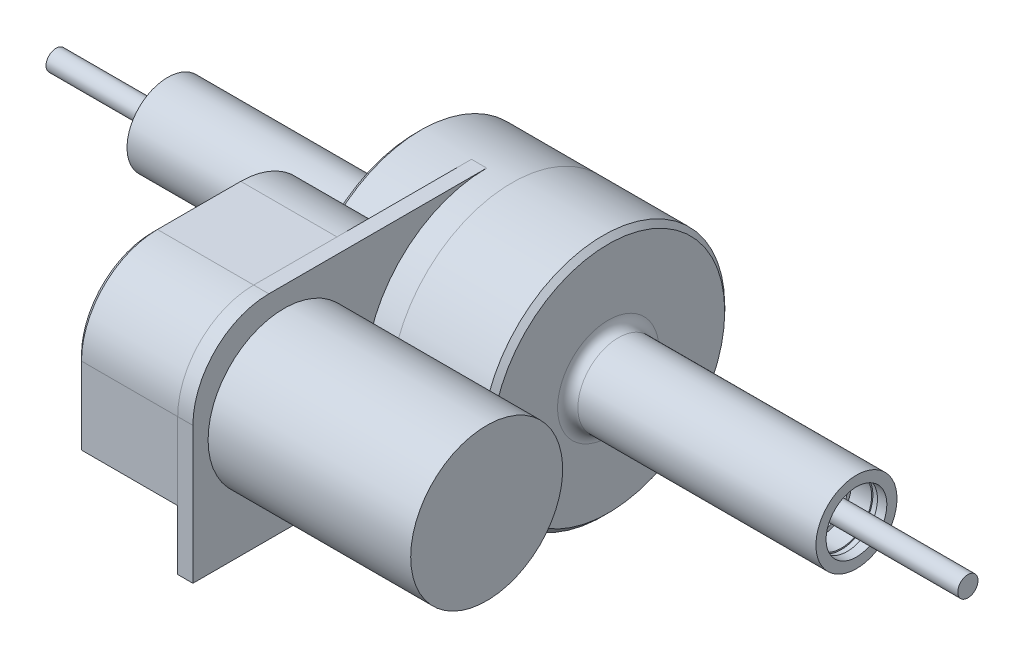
ISO-10303-21;
HEADER;
FILE_DESCRIPTION(('STEP AP214'),'2;1');
FILE_NAME('part.step','',(''),(''),'','','');
FILE_SCHEMA(('AUTOMOTIVE_DESIGN { 1 0 10303 214 1 1 1 1 }'));
ENDSEC;
DATA;
#1=APPLICATION_CONTEXT('core data for automotive mechanical design processes');
#2=APPLICATION_PROTOCOL_DEFINITION('international standard','automotive_design',2000,#1);
#3=PRODUCT_CONTEXT('',#1,'mechanical');
#4=PRODUCT('Part','Part','',(#3));
#5=PRODUCT_RELATED_PRODUCT_CATEGORY('part','',(#4));
#6=PRODUCT_DEFINITION_FORMATION('','',#4);
#7=PRODUCT_DEFINITION_CONTEXT('part definition',#1,'design');
#8=PRODUCT_DEFINITION('design','',#6,#7);
#9=PRODUCT_DEFINITION_SHAPE('','',#8);
#10=(LENGTH_UNIT() NAMED_UNIT(*) SI_UNIT(.MILLI.,.METRE.));
#11=(NAMED_UNIT(*) PLANE_ANGLE_UNIT() SI_UNIT($,.RADIAN.));
#12=(NAMED_UNIT(*) SI_UNIT($,.STERADIAN.) SOLID_ANGLE_UNIT());
#13=UNCERTAINTY_MEASURE_WITH_UNIT(LENGTH_MEASURE(1.E-05),#10,'distance_accuracy_value','');
#14=(GEOMETRIC_REPRESENTATION_CONTEXT(3) GLOBAL_UNCERTAINTY_ASSIGNED_CONTEXT((#13)) GLOBAL_UNIT_ASSIGNED_CONTEXT((#10,
#11,#12)) REPRESENTATION_CONTEXT('',''));
#15=CARTESIAN_POINT('',(0.,0.,0.));
#16=DIRECTION('',(0.,0.,1.));
#17=DIRECTION('',(1.,0.,0.));
#18=AXIS2_PLACEMENT_3D('',#15,#16,#17);
#19=CARTESIAN_POINT('',(-15.,0.,-300.));
#20=DIRECTION('',(1.,0.,0.));
#21=DIRECTION('',(0.,0.,-1.));
#22=AXIS2_PLACEMENT_3D('',#19,#20,#21);
#23=PLANE('',#22);
#24=CARTESIAN_POINT('',(-15.,0.,-300.));
#25=DIRECTION('',(1.,0.,0.));
#26=DIRECTION('',(0.,0.,-1.));
#27=AXIS2_PLACEMENT_3D('',#24,#25,#26);
#28=CIRCLE('',#27,20.);
#29=CARTESIAN_POINT('',(-15.,0.,-320.));
#30=VERTEX_POINT('',#29);
#31=EDGE_CURVE('E105',#30,#30,#28,.T.);
#32=ORIENTED_EDGE('',*,*,#31,.F.);
#33=EDGE_LOOP('',(#32));
#34=FACE_BOUND('',#33,.T.);
#35=CARTESIAN_POINT('',(-15.,0.,-300.));
#36=DIRECTION('',(1.,0.,0.));
#37=DIRECTION('',(0.,0.,-1.));
#38=AXIS2_PLACEMENT_3D('',#35,#36,#37);
#39=CIRCLE('',#38,2.99999999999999);
#40=CARTESIAN_POINT('',(-15.,0.,-303.));
#41=VERTEX_POINT('',#40);
#42=EDGE_CURVE('E13',#41,#41,#39,.F.);
#43=ORIENTED_EDGE('',*,*,#42,.F.);
#44=EDGE_LOOP('',(#43));
#45=FACE_BOUND('',#44,.T.);
#46=ADVANCED_FACE('F79',(#34,#45),#23,.F.);
#47=CARTESIAN_POINT('',(15.,0.,-300.));
#48=DIRECTION('',(1.,0.,0.));
#49=DIRECTION('',(0.,0.,-1.));
#50=AXIS2_PLACEMENT_3D('',#47,#48,#49);
#51=PLANE('',#50);
#52=CARTESIAN_POINT('',(15.,0.,-300.));
#53=DIRECTION('',(1.,0.,0.));
#54=DIRECTION('',(0.,0.,-1.));
#55=AXIS2_PLACEMENT_3D('',#52,#53,#54);
#56=CIRCLE('',#55,17.5);
#57=CARTESIAN_POINT('',(15.,0.,-317.5));
#58=VERTEX_POINT('',#57);
#59=EDGE_CURVE('E102',#58,#58,#56,.T.);
#60=ORIENTED_EDGE('',*,*,#59,.T.);
#61=EDGE_LOOP('',(#60));
#62=FACE_BOUND('',#61,.T.);
#63=CARTESIAN_POINT('',(15.,0.,-300.));
#64=DIRECTION('',(1.,0.,0.));
#65=DIRECTION('',(0.,0.,-1.));
#66=AXIS2_PLACEMENT_3D('',#63,#64,#65);
#67=CIRCLE('',#66,2.99999999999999);
#68=CARTESIAN_POINT('',(15.,0.,-303.));
#69=VERTEX_POINT('',#68);
#70=EDGE_CURVE('E97',#69,#69,#67,.F.);
#71=ORIENTED_EDGE('',*,*,#70,.T.);
#72=EDGE_LOOP('',(#71));
#73=FACE_BOUND('',#72,.T.);
#74=ADVANCED_FACE('F138',(#62,#73),#51,.T.);
#75=CARTESIAN_POINT('',(15.,0.,-300.));
#76=DIRECTION('',(-1.,0.,0.));
#77=DIRECTION('',(0.,0.,1.));
#78=AXIS2_PLACEMENT_3D('',#75,#76,#77);
#79=CYLINDRICAL_SURFACE('',#78,20.);
#80=CARTESIAN_POINT('',(-9.,0.,-300.));
#81=DIRECTION('',(-1.,0.,0.));
#82=DIRECTION('',(0.,0.,1.));
#83=AXIS2_PLACEMENT_3D('',#80,#81,#82);
#84=CIRCLE('',#83,20.);
#85=CARTESIAN_POINT('',(-9.,0.,-280.));
#86=VERTEX_POINT('',#85);
#87=EDGE_CURVE('E106',#86,#86,#84,.T.);
#88=ORIENTED_EDGE('',*,*,#87,.T.);
#89=EDGE_LOOP('',(#88));
#90=FACE_BOUND('',#89,.T.);
#91=ORIENTED_EDGE('',*,*,#31,.T.);
#92=EDGE_LOOP('',(#91));
#93=FACE_BOUND('',#92,.T.);
#94=ADVANCED_FACE('F144',(#90,#93),#79,.T.);
#95=CARTESIAN_POINT('',(-9.,0.,-288.));
#96=DIRECTION('',(-1.,0.,0.));
#97=DIRECTION('',(0.,0.,1.));
#98=AXIS2_PLACEMENT_3D('',#95,#96,#97);
#99=PLANE('',#98);
#100=CARTESIAN_POINT('',(-9.,0.,-300.));
#101=DIRECTION('',(-1.,0.,0.));
#102=DIRECTION('',(0.,0.,1.));
#103=AXIS2_PLACEMENT_3D('',#100,#101,#102);
#104=CIRCLE('',#103,17.5);
#105=CARTESIAN_POINT('',(-9.,0.,-282.5));
#106=VERTEX_POINT('',#105);
#107=EDGE_CURVE('E100',#106,#106,#104,.T.);
#108=ORIENTED_EDGE('',*,*,#107,.T.);
#109=EDGE_LOOP('',(#108));
#110=FACE_BOUND('',#109,.T.);
#111=ORIENTED_EDGE('',*,*,#87,.F.);
#112=EDGE_LOOP('',(#111));
#113=FACE_BOUND('',#112,.T.);
#114=ADVANCED_FACE('F153',(#110,#113),#99,.F.);
#115=CARTESIAN_POINT('',(90.,0.,-300.));
#116=DIRECTION('',(-1.,0.,0.));
#117=DIRECTION('',(0.,0.,1.));
#118=AXIS2_PLACEMENT_3D('',#115,#116,#117);
#119=CYLINDRICAL_SURFACE('',#118,17.5);
#120=ORIENTED_EDGE('',*,*,#59,.F.);
#121=EDGE_LOOP('',(#120));
#122=FACE_BOUND('',#121,.T.);
#123=ORIENTED_EDGE('',*,*,#107,.F.);
#124=EDGE_LOOP('',(#123));
#125=FACE_BOUND('',#124,.T.);
#126=ADVANCED_FACE('F172',(#122,#125),#119,.T.);
#127=CARTESIAN_POINT('',(61.,0.,-300.));
#128=DIRECTION('',(-1.,0.,0.));
#129=DIRECTION('',(0.,0.,1.));
#130=AXIS2_PLACEMENT_3D('',#127,#128,#129);
#131=PLANE('',#130);
#132=CARTESIAN_POINT('',(61.,0.,-300.));
#133=DIRECTION('',(-1.,0.,0.));
#134=DIRECTION('',(0.,0.,1.));
#135=AXIS2_PLACEMENT_3D('',#132,#133,#134);
#136=CIRCLE('',#135,2.99999999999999);
#137=CARTESIAN_POINT('',(61.,0.,-297.));
#138=VERTEX_POINT('',#137);
#139=EDGE_CURVE('E101',#138,#138,#136,.T.);
#140=ORIENTED_EDGE('',*,*,#139,.F.);
#141=EDGE_LOOP('',(#140));
#142=FACE_BOUND('',#141,.T.);
#143=CARTESIAN_POINT('',(61.,0.,-300.));
#144=DIRECTION('',(-1.,0.,0.));
#145=DIRECTION('',(0.,0.,1.));
#146=AXIS2_PLACEMENT_3D('',#143,#144,#145);
#147=CIRCLE('',#146,2.);
#148=CARTESIAN_POINT('',(61.,0.,-298.));
#149=VERTEX_POINT('',#148);
#150=EDGE_CURVE('E90',#149,#149,#147,.T.);
#151=ORIENTED_EDGE('',*,*,#150,.T.);
#152=EDGE_LOOP('',(#151));
#153=FACE_BOUND('',#152,.T.);
#154=ADVANCED_FACE('F164',(#142,#153),#131,.F.);
#155=CARTESIAN_POINT('',(69.4852813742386,0.,-300.));
#156=DIRECTION('',(-1.,0.,0.));
#157=DIRECTION('',(0.,0.,1.));
#158=AXIS2_PLACEMENT_3D('',#155,#156,#157);
#159=CYLINDRICAL_SURFACE('',#158,2.99999999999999);
#160=ORIENTED_EDGE('',*,*,#70,.F.);
#161=EDGE_LOOP('',(#160));
#162=FACE_BOUND('',#161,.T.);
#163=ORIENTED_EDGE('',*,*,#139,.T.);
#164=EDGE_LOOP('',(#163));
#165=FACE_BOUND('',#164,.T.);
#166=ADVANCED_FACE('F157',(#162,#165),#159,.T.);
#167=CARTESIAN_POINT('',(90.,0.,-300.));
#168=DIRECTION('',(1.,0.,0.));
#169=DIRECTION('',(0.,0.,-1.));
#170=AXIS2_PLACEMENT_3D('',#167,#168,#169);
#171=PLANE('',#170);
#172=CARTESIAN_POINT('',(90.,0.,-300.));
#173=DIRECTION('',(1.,0.,0.));
#174=DIRECTION('',(0.,0.,-1.));
#175=AXIS2_PLACEMENT_3D('',#172,#173,#174);
#176=CIRCLE('',#175,2.);
#177=CARTESIAN_POINT('',(90.,0.,-298.));
#178=VERTEX_POINT('',#177);
#179=EDGE_CURVE('E94',#178,#178,#176,.T.);
#180=ORIENTED_EDGE('',*,*,#179,.T.);
#181=EDGE_LOOP('',(#180));
#182=FACE_BOUND('',#181,.T.);
#183=ADVANCED_FACE('F155',(#182),#171,.T.);
#184=CARTESIAN_POINT('',(90.,0.,-300.));
#185=DIRECTION('',(-1.,0.,0.));
#186=DIRECTION('',(0.,0.,1.));
#187=AXIS2_PLACEMENT_3D('',#184,#185,#186);
#188=CYLINDRICAL_SURFACE('',#187,2.);
#189=CARTESIAN_POINT('',(90.,0.,-298.));
#190=CARTESIAN_POINT('',(89.6979166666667,0.,-298.));
#191=CARTESIAN_POINT('',(89.3958333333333,0.,-298.));
#192=CARTESIAN_POINT('',(88.7916666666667,0.,-298.));
#193=CARTESIAN_POINT('',(88.4895833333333,0.,-298.));
#194=CARTESIAN_POINT('',(87.8854166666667,0.,-298.));
#195=CARTESIAN_POINT('',(87.5833333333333,0.,-298.));
#196=CARTESIAN_POINT('',(86.9791666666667,0.,-298.));
#197=CARTESIAN_POINT('',(86.6770833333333,0.,-298.));
#198=CARTESIAN_POINT('',(86.0729166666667,0.,-298.));
#199=CARTESIAN_POINT('',(85.7708333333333,0.,-298.));
#200=CARTESIAN_POINT('',(85.1666666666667,0.,-298.));
#201=CARTESIAN_POINT('',(84.8645833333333,0.,-298.));
#202=CARTESIAN_POINT('',(84.2604166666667,0.,-298.));
#203=CARTESIAN_POINT('',(83.9583333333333,0.,-298.));
#204=CARTESIAN_POINT('',(83.3541666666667,0.,-298.));
#205=CARTESIAN_POINT('',(83.0520833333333,0.,-298.));
#206=CARTESIAN_POINT('',(82.4479166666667,0.,-298.));
#207=CARTESIAN_POINT('',(82.1458333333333,0.,-298.));
#208=CARTESIAN_POINT('',(81.5416666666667,0.,-298.));
#209=CARTESIAN_POINT('',(81.2395833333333,0.,-298.));
#210=CARTESIAN_POINT('',(80.6354166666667,0.,-298.));
#211=CARTESIAN_POINT('',(80.3333333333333,0.,-298.));
#212=CARTESIAN_POINT('',(79.7291666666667,0.,-298.));
#213=CARTESIAN_POINT('',(79.4270833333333,0.,-298.));
#214=CARTESIAN_POINT('',(78.8229166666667,0.,-298.));
#215=CARTESIAN_POINT('',(78.5208333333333,0.,-298.));
#216=CARTESIAN_POINT('',(77.9166666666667,0.,-298.));
#217=CARTESIAN_POINT('',(77.6145833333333,0.,-298.));
#218=CARTESIAN_POINT('',(77.0104166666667,0.,-298.));
#219=CARTESIAN_POINT('',(76.7083333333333,0.,-298.));
#220=CARTESIAN_POINT('',(76.1041666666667,0.,-298.));
#221=CARTESIAN_POINT('',(75.8020833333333,0.,-298.));
#222=CARTESIAN_POINT('',(75.1979166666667,0.,-298.));
#223=CARTESIAN_POINT('',(74.8958333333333,0.,-298.));
#224=CARTESIAN_POINT('',(74.2916666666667,0.,-298.));
#225=CARTESIAN_POINT('',(73.9895833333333,0.,-298.));
#226=CARTESIAN_POINT('',(73.3854166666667,0.,-298.));
#227=CARTESIAN_POINT('',(73.0833333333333,0.,-298.));
#228=CARTESIAN_POINT('',(72.4791666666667,0.,-298.));
#229=CARTESIAN_POINT('',(72.1770833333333,0.,-298.));
#230=CARTESIAN_POINT('',(71.5729166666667,0.,-298.));
#231=CARTESIAN_POINT('',(71.2708333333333,0.,-298.));
#232=CARTESIAN_POINT('',(70.6666666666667,0.,-298.));
#233=CARTESIAN_POINT('',(70.3645833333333,0.,-298.));
#234=CARTESIAN_POINT('',(69.7604166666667,0.,-298.));
#235=CARTESIAN_POINT('',(69.4583333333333,0.,-298.));
#236=CARTESIAN_POINT('',(68.8541666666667,0.,-298.));
#237=CARTESIAN_POINT('',(68.5520833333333,0.,-298.));
#238=CARTESIAN_POINT('',(67.9479166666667,0.,-298.));
#239=CARTESIAN_POINT('',(67.6458333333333,0.,-298.));
#240=CARTESIAN_POINT('',(67.0416666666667,0.,-298.));
#241=CARTESIAN_POINT('',(66.7395833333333,0.,-298.));
#242=CARTESIAN_POINT('',(66.1354166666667,0.,-298.));
#243=CARTESIAN_POINT('',(65.8333333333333,0.,-298.));
#244=CARTESIAN_POINT('',(65.2291666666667,0.,-298.));
#245=CARTESIAN_POINT('',(64.9270833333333,0.,-298.));
#246=CARTESIAN_POINT('',(64.3229166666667,0.,-298.));
#247=CARTESIAN_POINT('',(64.0208333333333,0.,-298.));
#248=CARTESIAN_POINT('',(63.4166666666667,0.,-298.));
#249=CARTESIAN_POINT('',(63.1145833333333,0.,-298.));
#250=CARTESIAN_POINT('',(62.5104166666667,0.,-298.));
#251=CARTESIAN_POINT('',(62.2083333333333,0.,-298.));
#252=CARTESIAN_POINT('',(61.6041666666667,0.,-298.));
#253=CARTESIAN_POINT('',(61.3020833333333,0.,-298.));
#254=CARTESIAN_POINT('',(61.,0.,-298.));
#255=B_SPLINE_CURVE_WITH_KNOTS('',3,(#189,#190,#191,#192,#193,#194,#195,#196,#197,#198,#199,
#200,#201,#202,#203,#204,#205,#206,#207,#208,#209,#210,#211,#212,#213,#214,#215,#216,#217,#218,
#219,#220,#221,#222,#223,#224,#225,#226,#227,#228,#229,#230,#231,#232,#233,#234,#235,#236,#237,
#238,#239,#240,#241,#242,#243,#244,#245,#246,#247,#248,#249,#250,#251,#252,#253,#254),
.UNSPECIFIED.,.F.,.F.,(4,2,2,2,2,2,2,2,2,2,2,2,2,2,2,2,2,2,2,2,2,2,2,2,2,2,2,2,2,2,2,2,4),(0.,
0.906249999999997,1.81249999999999,2.71874999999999,3.62499999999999,4.53124999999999,
5.43749999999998,6.34375,7.24999999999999,8.15624999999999,9.06249999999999,9.96874999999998,
10.875,11.78125,12.6875,13.59375,14.5,15.40625,16.3125,17.21875,18.125,19.03125,19.9375,
20.84375,21.75,22.65625,23.5625,24.46875,25.375,26.28125,27.1875,28.09375,29.),.UNSPECIFIED.);
#256=EDGE_CURVE('BSEAM81',#178,#149,#255,.T.);
#257=ORIENTED_EDGE('',*,*,#179,.F.);
#258=ORIENTED_EDGE('',*,*,#150,.F.);
#259=ORIENTED_EDGE('',*,*,#256,.T.);
#260=ORIENTED_EDGE('',*,*,#256,.F.);
#261=EDGE_LOOP('',(#257,#259,#258,#260));
#262=FACE_BOUND('',#261,.T.);
#263=ADVANCED_FACE('F81',(#262),#188,.T.);
#264=CARTESIAN_POINT('',(-61.,0.,-300.));
#265=DIRECTION('',(1.,0.,0.));
#266=DIRECTION('',(0.,0.,1.));
#267=AXIS2_PLACEMENT_3D('',#264,#265,#266);
#268=PLANE('',#267);
#269=CARTESIAN_POINT('',(-61.,0.,-300.));
#270=DIRECTION('',(-1.,0.,0.));
#271=DIRECTION('',(0.,0.,1.));
#272=AXIS2_PLACEMENT_3D('',#269,#270,#271);
#273=CIRCLE('',#272,2.99999999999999);
#274=CARTESIAN_POINT('',(-61.,0.,-297.));
#275=VERTEX_POINT('',#274);
#276=EDGE_CURVE('E120',#275,#275,#273,.T.);
#277=ORIENTED_EDGE('',*,*,#276,.T.);
#278=EDGE_LOOP('',(#277));
#279=FACE_BOUND('',#278,.T.);
#280=CARTESIAN_POINT('',(-61.,0.,-300.));
#281=DIRECTION('',(1.,0.,0.));
#282=DIRECTION('',(0.,0.,-1.));
#283=AXIS2_PLACEMENT_3D('',#280,#281,#282);
#284=CIRCLE('',#283,2.);
#285=CARTESIAN_POINT('',(-61.,0.,-298.));
#286=VERTEX_POINT('',#285);
#287=EDGE_CURVE('E86',#286,#286,#284,.T.);
#288=ORIENTED_EDGE('',*,*,#287,.T.);
#289=EDGE_LOOP('',(#288));
#290=FACE_BOUND('',#289,.T.);
#291=ADVANCED_FACE('F124',(#279,#290),#268,.F.);
#292=CARTESIAN_POINT('',(-69.4852813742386,0.,-300.));
#293=DIRECTION('',(1.,0.,0.));
#294=DIRECTION('',(0.,0.,1.));
#295=AXIS2_PLACEMENT_3D('',#292,#293,#294);
#296=CYLINDRICAL_SURFACE('',#295,2.99999999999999);
#297=ORIENTED_EDGE('',*,*,#42,.T.);
#298=EDGE_LOOP('',(#297));
#299=FACE_BOUND('',#298,.T.);
#300=ORIENTED_EDGE('',*,*,#276,.F.);
#301=EDGE_LOOP('',(#300));
#302=FACE_BOUND('',#301,.T.);
#303=ADVANCED_FACE('F126',(#299,#302),#296,.T.);
#304=CARTESIAN_POINT('',(-90.,0.,-300.));
#305=DIRECTION('',(1.,0.,0.));
#306=DIRECTION('',(0.,0.,-1.));
#307=AXIS2_PLACEMENT_3D('',#304,#305,#306);
#308=PLANE('',#307);
#309=CARTESIAN_POINT('',(-90.,0.,-300.));
#310=DIRECTION('',(1.,0.,0.));
#311=DIRECTION('',(0.,0.,-1.));
#312=AXIS2_PLACEMENT_3D('',#309,#310,#311);
#313=CIRCLE('',#312,2.);
#314=CARTESIAN_POINT('',(-90.,0.,-298.));
#315=VERTEX_POINT('',#314);
#316=EDGE_CURVE('E109',#315,#315,#313,.T.);
#317=ORIENTED_EDGE('',*,*,#316,.F.);
#318=EDGE_LOOP('',(#317));
#319=FACE_BOUND('',#318,.T.);
#320=ADVANCED_FACE('F128',(#319),#308,.F.);
#321=CARTESIAN_POINT('',(-90.,0.,-298.));
#322=CARTESIAN_POINT('',(-89.6979166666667,0.,-298.));
#323=CARTESIAN_POINT('',(-89.3958333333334,0.,-298.));
#324=CARTESIAN_POINT('',(-88.7916666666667,0.,-298.));
#325=CARTESIAN_POINT('',(-88.4895833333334,0.,-298.));
#326=CARTESIAN_POINT('',(-87.8854166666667,0.,-298.));
#327=CARTESIAN_POINT('',(-87.5833333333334,0.,-298.));
#328=CARTESIAN_POINT('',(-86.9791666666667,0.,-298.));
#329=CARTESIAN_POINT('',(-86.6770833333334,0.,-298.));
#330=CARTESIAN_POINT('',(-86.0729166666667,0.,-298.));
#331=CARTESIAN_POINT('',(-85.7708333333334,0.,-298.));
#332=CARTESIAN_POINT('',(-85.1666666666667,0.,-298.));
#333=CARTESIAN_POINT('',(-84.8645833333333,0.,-298.));
#334=CARTESIAN_POINT('',(-84.2604166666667,0.,-298.));
#335=CARTESIAN_POINT('',(-83.9583333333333,0.,-298.));
#336=CARTESIAN_POINT('',(-83.3541666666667,0.,-298.));
#337=CARTESIAN_POINT('',(-83.0520833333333,0.,-298.));
#338=CARTESIAN_POINT('',(-82.4479166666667,0.,-298.));
#339=CARTESIAN_POINT('',(-82.1458333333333,0.,-298.));
#340=CARTESIAN_POINT('',(-81.5416666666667,0.,-298.));
#341=CARTESIAN_POINT('',(-81.2395833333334,0.,-298.));
#342=CARTESIAN_POINT('',(-80.6354166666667,0.,-298.));
#343=CARTESIAN_POINT('',(-80.3333333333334,0.,-298.));
#344=CARTESIAN_POINT('',(-79.7291666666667,0.,-298.));
#345=CARTESIAN_POINT('',(-79.4270833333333,0.,-298.));
#346=CARTESIAN_POINT('',(-78.8229166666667,0.,-298.));
#347=CARTESIAN_POINT('',(-78.5208333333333,0.,-298.));
#348=CARTESIAN_POINT('',(-77.9166666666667,0.,-298.));
#349=CARTESIAN_POINT('',(-77.6145833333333,0.,-298.));
#350=CARTESIAN_POINT('',(-77.0104166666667,0.,-298.));
#351=CARTESIAN_POINT('',(-76.7083333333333,0.,-298.));
#352=CARTESIAN_POINT('',(-76.1041666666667,0.,-298.));
#353=CARTESIAN_POINT('',(-75.8020833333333,0.,-298.));
#354=CARTESIAN_POINT('',(-75.1979166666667,0.,-298.));
#355=CARTESIAN_POINT('',(-74.8958333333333,0.,-298.));
#356=CARTESIAN_POINT('',(-74.2916666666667,0.,-298.));
#357=CARTESIAN_POINT('',(-73.9895833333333,0.,-298.));
#358=CARTESIAN_POINT('',(-73.3854166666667,0.,-298.));
#359=CARTESIAN_POINT('',(-73.0833333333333,0.,-298.));
#360=CARTESIAN_POINT('',(-72.4791666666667,0.,-298.));
#361=CARTESIAN_POINT('',(-72.1770833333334,0.,-298.));
#362=CARTESIAN_POINT('',(-71.5729166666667,0.,-298.));
#363=CARTESIAN_POINT('',(-71.2708333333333,0.,-298.));
#364=CARTESIAN_POINT('',(-70.6666666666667,0.,-298.));
#365=CARTESIAN_POINT('',(-70.3645833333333,0.,-298.));
#366=CARTESIAN_POINT('',(-69.7604166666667,0.,-298.));
#367=CARTESIAN_POINT('',(-69.4583333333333,0.,-298.));
#368=CARTESIAN_POINT('',(-68.8541666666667,0.,-298.));
#369=CARTESIAN_POINT('',(-68.5520833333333,0.,-298.));
#370=CARTESIAN_POINT('',(-67.9479166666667,0.,-298.));
#371=CARTESIAN_POINT('',(-67.6458333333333,0.,-298.));
#372=CARTESIAN_POINT('',(-67.0416666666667,0.,-298.));
#373=CARTESIAN_POINT('',(-66.7395833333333,0.,-298.));
#374=CARTESIAN_POINT('',(-66.1354166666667,0.,-298.));
#375=CARTESIAN_POINT('',(-65.8333333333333,0.,-298.));
#376=CARTESIAN_POINT('',(-65.2291666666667,0.,-298.));
#377=CARTESIAN_POINT('',(-64.9270833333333,0.,-298.));
#378=CARTESIAN_POINT('',(-64.3229166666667,0.,-298.));
#379=CARTESIAN_POINT('',(-64.0208333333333,0.,-298.));
#380=CARTESIAN_POINT('',(-63.4166666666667,0.,-298.));
#381=CARTESIAN_POINT('',(-63.1145833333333,0.,-298.));
#382=CARTESIAN_POINT('',(-62.5104166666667,0.,-298.));
#383=CARTESIAN_POINT('',(-62.2083333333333,0.,-298.));
#384=CARTESIAN_POINT('',(-61.6041666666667,0.,-298.));
#385=CARTESIAN_POINT('',(-61.3020833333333,0.,-298.));
#386=CARTESIAN_POINT('',(-61.,0.,-298.));
#387=B_SPLINE_CURVE_WITH_KNOTS('',3,(#321,#322,#323,#324,#325,#326,#327,#328,#329,#330,#331,
#332,#333,#334,#335,#336,#337,#338,#339,#340,#341,#342,#343,#344,#345,#346,#347,#348,#349,#350,
#351,#352,#353,#354,#355,#356,#357,#358,#359,#360,#361,#362,#363,#364,#365,#366,#367,#368,#369,
#370,#371,#372,#373,#374,#375,#376,#377,#378,#379,#380,#381,#382,#383,#384,#385,#386),
.UNSPECIFIED.,.F.,.F.,(4,2,2,2,2,2,2,2,2,2,2,2,2,2,2,2,2,2,2,2,2,2,2,2,2,2,2,2,2,2,2,2,4),(0.,
0.906249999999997,1.81249999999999,2.71874999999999,3.62499999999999,4.53125000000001,
5.43750000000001,6.34375000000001,7.25000000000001,8.15625,9.0625,9.96875,10.875,11.78125,
12.6875,13.59375,14.5,15.40625,16.3125,17.21875,18.125,19.03125,19.9375,20.84375,21.75,22.65625,
23.5625,24.46875,25.375,26.28125,27.1875,28.09375,29.),.UNSPECIFIED.);
#388=EDGE_CURVE('BSEAM134',#315,#286,#387,.T.);
#389=ORIENTED_EDGE('',*,*,#316,.T.);
#390=ORIENTED_EDGE('',*,*,#287,.F.);
#391=ORIENTED_EDGE('',*,*,#388,.T.);
#392=ORIENTED_EDGE('',*,*,#388,.F.);
#393=EDGE_LOOP('',(#389,#391,#390,#392));
#394=FACE_BOUND('',#393,.T.);
#395=ADVANCED_FACE('F134',(#394),#188,.T.);
#396=CLOSED_SHELL('',(#46,#74,#94,#114,#126,#154,#166,#183,#263,#291,#303,#320,#395));
#397=MANIFOLD_SOLID_BREP('B2',#396);
#398=CARTESIAN_POINT('',(13.6274169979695,8.88991235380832,-273.448739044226));
#399=DIRECTION('',(-1.,0.,0.));
#400=DIRECTION('',(0.,0.,1.));
#401=AXIS2_PLACEMENT_3D('',#398,#399,#400);
#402=CYLINDRICAL_SURFACE('',#401,7.99999999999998);
#403=CARTESIAN_POINT('',(-9.,8.88991235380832,-273.448739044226));
#404=DIRECTION('',(-1.,0.,0.));
#405=DIRECTION('',(0.,0.,1.));
#406=AXIS2_PLACEMENT_3D('',#403,#404,#405);
#407=CIRCLE('',#406,7.99999999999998);
#408=CARTESIAN_POINT('',(-9.,8.88991235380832,-265.448739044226));
#409=VERTEX_POINT('',#408);
#410=EDGE_CURVE('E78',#409,#409,#407,.F.);
#411=ORIENTED_EDGE('',*,*,#410,.F.);
#412=EDGE_LOOP('',(#411));
#413=FACE_BOUND('',#412,.T.);
#414=CARTESIAN_POINT('',(-17.,8.88991235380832,-273.448739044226));
#415=DIRECTION('',(-1.,0.,0.));
#416=DIRECTION('',(0.,0.,1.));
#417=AXIS2_PLACEMENT_3D('',#414,#415,#416);
#418=CIRCLE('',#417,7.99999999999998);
#419=CARTESIAN_POINT('',(-17.,8.88991235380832,-265.448739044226));
#420=VERTEX_POINT('',#419);
#421=EDGE_CURVE('E282',#420,#420,#418,.T.);
#422=ORIENTED_EDGE('',*,*,#421,.F.);
#423=EDGE_LOOP('',(#422));
#424=FACE_BOUND('',#423,.T.);
#425=ADVANCED_FACE('F276',(#413,#424),#402,.T.);
#426=CARTESIAN_POINT('',(-9.,0.,0.));
#427=DIRECTION('',(-1.,0.,0.));
#428=DIRECTION('',(0.,0.,1.));
#429=AXIS2_PLACEMENT_3D('',#426,#427,#428);
#430=PLANE('',#429);
#431=CARTESIAN_POINT('',(-8.99999999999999,8.88991235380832,-273.448739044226));
#432=DIRECTION('',(-1.,0.,0.));
#433=DIRECTION('',(0.,0.,1.));
#434=AXIS2_PLACEMENT_3D('',#431,#432,#433);
#435=CIRCLE('',#434,1.50000000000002);
#436=CARTESIAN_POINT('',(-8.99999999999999,8.88991235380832,-271.948739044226));
#437=VERTEX_POINT('',#436);
#438=EDGE_CURVE('E294',#437,#437,#435,.T.);
#439=ORIENTED_EDGE('',*,*,#438,.T.);
#440=EDGE_LOOP('',(#439));
#441=FACE_BOUND('',#440,.T.);
#442=ORIENTED_EDGE('',*,*,#410,.T.);
#443=EDGE_LOOP('',(#442));
#444=FACE_BOUND('',#443,.T.);
#445=ADVANCED_FACE('F315',(#441,#444),#430,.F.);
#446=CARTESIAN_POINT('',(-25.,8.88991235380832,-273.448739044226));
#447=DIRECTION('',(1.,0.,0.));
#448=DIRECTION('',(0.,0.,-1.));
#449=AXIS2_PLACEMENT_3D('',#446,#447,#448);
#450=CYLINDRICAL_SURFACE('',#449,9.99999999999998);
#451=CARTESIAN_POINT('',(-25.,8.88991235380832,-273.448739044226));
#452=DIRECTION('',(-1.,0.,0.));
#453=DIRECTION('',(0.,0.,1.));
#454=AXIS2_PLACEMENT_3D('',#451,#452,#453);
#455=CIRCLE('',#454,9.99999999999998);
#456=CARTESIAN_POINT('',(-25.,8.88991235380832,-263.448739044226));
#457=VERTEX_POINT('',#456);
#458=EDGE_CURVE('E286',#457,#457,#455,.T.);
#459=ORIENTED_EDGE('',*,*,#458,.F.);
#460=EDGE_LOOP('',(#459));
#461=FACE_BOUND('',#460,.T.);
#462=CARTESIAN_POINT('',(-17.,8.88991235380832,-273.448739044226));
#463=DIRECTION('',(-1.,0.,0.));
#464=DIRECTION('',(0.,0.,1.));
#465=AXIS2_PLACEMENT_3D('',#462,#463,#464);
#466=CIRCLE('',#465,9.99999999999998);
#467=CARTESIAN_POINT('',(-17.,8.88991235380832,-263.448739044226));
#468=VERTEX_POINT('',#467);
#469=EDGE_CURVE('E290',#468,#468,#466,.T.);
#470=ORIENTED_EDGE('',*,*,#469,.T.);
#471=EDGE_LOOP('',(#470));
#472=FACE_BOUND('',#471,.T.);
#473=ADVANCED_FACE('F309',(#461,#472),#450,.T.);
#474=CARTESIAN_POINT('',(-25.,8.88991235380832,-273.448739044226));
#475=DIRECTION('',(-1.,0.,0.));
#476=DIRECTION('',(0.,0.,1.));
#477=AXIS2_PLACEMENT_3D('',#474,#475,#476);
#478=PLANE('',#477);
#479=CARTESIAN_POINT('',(-25.,8.88991235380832,-273.448739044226));
#480=DIRECTION('',(-1.,0.,0.));
#481=DIRECTION('',(0.,0.,1.));
#482=AXIS2_PLACEMENT_3D('',#479,#480,#481);
#483=CIRCLE('',#482,1.50000000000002);
#484=CARTESIAN_POINT('',(-25.,8.88991235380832,-271.948739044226));
#485=VERTEX_POINT('',#484);
#486=EDGE_CURVE('E298',#485,#485,#483,.T.);
#487=ORIENTED_EDGE('',*,*,#486,.F.);
#488=EDGE_LOOP('',(#487));
#489=FACE_BOUND('',#488,.T.);
#490=ORIENTED_EDGE('',*,*,#458,.T.);
#491=EDGE_LOOP('',(#490));
#492=FACE_BOUND('',#491,.T.);
#493=ADVANCED_FACE('F305',(#489,#492),#478,.T.);
#494=CARTESIAN_POINT('',(-17.,8.88991235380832,-273.448739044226));
#495=DIRECTION('',(-1.,0.,0.));
#496=DIRECTION('',(0.,0.,1.));
#497=AXIS2_PLACEMENT_3D('',#494,#495,#496);
#498=PLANE('',#497);
#499=ORIENTED_EDGE('',*,*,#421,.T.);
#500=EDGE_LOOP('',(#499));
#501=FACE_BOUND('',#500,.T.);
#502=ORIENTED_EDGE('',*,*,#469,.F.);
#503=EDGE_LOOP('',(#502));
#504=FACE_BOUND('',#503,.T.);
#505=ADVANCED_FACE('F308',(#501,#504),#498,.F.);
#506=CARTESIAN_POINT('',(90.,8.88991235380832,-273.448739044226));
#507=DIRECTION('',(-1.,0.,0.));
#508=DIRECTION('',(0.,0.,1.));
#509=AXIS2_PLACEMENT_3D('',#506,#507,#508);
#510=CYLINDRICAL_SURFACE('',#509,1.50000000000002);
#511=ORIENTED_EDGE('',*,*,#486,.T.);
#512=EDGE_LOOP('',(#511));
#513=FACE_BOUND('',#512,.T.);
#514=ORIENTED_EDGE('',*,*,#438,.F.);
#515=EDGE_LOOP('',(#514));
#516=FACE_BOUND('',#515,.T.);
#517=ADVANCED_FACE('F302',(#513,#516),#510,.F.);
#518=CLOSED_SHELL('',(#425,#445,#473,#493,#505,#517));
#519=MANIFOLD_SOLID_BREP('B8',#518);
#520=CARTESIAN_POINT('',(0.,0.,0.));
#521=DIRECTION('',(1.,0.,0.));
#522=DIRECTION('',(0.,0.,-1.));
#523=AXIS2_PLACEMENT_3D('',#520,#521,#522);
#524=PLANE('',#523);
#525=CARTESIAN_POINT('',(0.,0.,-300.));
#526=DIRECTION('',(1.,0.,0.));
#527=DIRECTION('',(0.,0.,-1.));
#528=AXIS2_PLACEMENT_3D('',#525,#526,#527);
#529=CIRCLE('',#528,24.);
#530=CARTESIAN_POINT('',(0.,0.,-324.));
#531=VERTEX_POINT('',#530);
#532=EDGE_CURVE('E380',#531,#531,#529,.F.);
#533=ORIENTED_EDGE('',*,*,#532,.T.);
#534=EDGE_LOOP('',(#533));
#535=FACE_BOUND('',#534,.T.);
#536=CARTESIAN_POINT('',(0.,0.,-300.));
#537=DIRECTION('',(1.,0.,0.));
#538=DIRECTION('',(0.,0.,-1.));
#539=AXIS2_PLACEMENT_3D('',#536,#537,#538);
#540=CIRCLE('',#539,22.);
#541=CARTESIAN_POINT('',(0.,0.,-322.));
#542=VERTEX_POINT('',#541);
#543=EDGE_CURVE('E275',#542,#542,#540,.T.);
#544=ORIENTED_EDGE('',*,*,#543,.T.);
#545=EDGE_LOOP('',(#544));
#546=FACE_BOUND('',#545,.T.);
#547=ADVANCED_FACE('F377',(#535,#546),#524,.F.);
#548=CARTESIAN_POINT('',(-17.,0.,-300.));
#549=DIRECTION('',(-1.,0.,0.));
#550=DIRECTION('',(0.,0.,-1.));
#551=AXIS2_PLACEMENT_3D('',#548,#549,#550);
#552=CYLINDRICAL_SURFACE('',#551,24.);
#553=ORIENTED_EDGE('',*,*,#532,.F.);
#554=EDGE_LOOP('',(#553));
#555=FACE_BOUND('',#554,.T.);
#556=CARTESIAN_POINT('',(18.0000000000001,0.,-300.));
#557=DIRECTION('',(1.,0.,0.));
#558=DIRECTION('',(0.,0.,-1.));
#559=AXIS2_PLACEMENT_3D('',#556,#557,#558);
#560=CIRCLE('',#559,24.);
#561=CARTESIAN_POINT('',(18.0000000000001,0.,-324.));
#562=VERTEX_POINT('',#561);
#563=EDGE_CURVE('E394',#562,#562,#560,.F.);
#564=ORIENTED_EDGE('',*,*,#563,.T.);
#565=EDGE_LOOP('',(#564));
#566=FACE_BOUND('',#565,.T.);
#567=ADVANCED_FACE('F436',(#555,#566),#552,.T.);
#568=CARTESIAN_POINT('',(19.,0.,-300.));
#569=DIRECTION('',(-1.,0.,0.));
#570=DIRECTION('',(0.,0.,1.));
#571=AXIS2_PLACEMENT_3D('',#568,#569,#570);
#572=CYLINDRICAL_SURFACE('',#571,22.);
#573=ORIENTED_EDGE('',*,*,#543,.F.);
#574=EDGE_LOOP('',(#573));
#575=FACE_BOUND('',#574,.T.);
#576=CARTESIAN_POINT('',(17.,0.,-300.));
#577=DIRECTION('',(1.,0.,0.));
#578=DIRECTION('',(0.,0.,-1.));
#579=AXIS2_PLACEMENT_3D('',#576,#577,#578);
#580=CIRCLE('',#579,22.);
#581=CARTESIAN_POINT('',(17.,0.,-322.));
#582=VERTEX_POINT('',#581);
#583=EDGE_CURVE('E405',#582,#582,#580,.F.);
#584=ORIENTED_EDGE('',*,*,#583,.F.);
#585=EDGE_LOOP('',(#584));
#586=FACE_BOUND('',#585,.T.);
#587=ADVANCED_FACE('F434',(#575,#586),#572,.F.);
#588=CARTESIAN_POINT('',(17.,0.,-300.));
#589=DIRECTION('',(1.,0.,0.));
#590=DIRECTION('',(0.,0.,-1.));
#591=AXIS2_PLACEMENT_3D('',#588,#589,#590);
#592=PLANE('',#591);
#593=ORIENTED_EDGE('',*,*,#583,.T.);
#594=EDGE_LOOP('',(#593));
#595=FACE_BOUND('',#594,.T.);
#596=CARTESIAN_POINT('',(17.,0.,-300.));
#597=DIRECTION('',(1.,0.,0.));
#598=DIRECTION('',(0.,0.,-1.));
#599=AXIS2_PLACEMENT_3D('',#596,#597,#598);
#600=CIRCLE('',#599,5.30000000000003);
#601=CARTESIAN_POINT('',(17.,0.,-305.3));
#602=VERTEX_POINT('',#601);
#603=EDGE_CURVE('E404',#602,#602,#600,.T.);
#604=ORIENTED_EDGE('',*,*,#603,.T.);
#605=EDGE_LOOP('',(#604));
#606=FACE_BOUND('',#605,.T.);
#607=ADVANCED_FACE('F431',(#595,#606),#592,.F.);
#608=CARTESIAN_POINT('',(19.,0.,-300.));
#609=DIRECTION('',(1.,0.,0.));
#610=DIRECTION('',(0.,0.,-1.));
#611=AXIS2_PLACEMENT_3D('',#608,#609,#610);
#612=PLANE('',#611);
#613=CARTESIAN_POINT('',(19.,0.,-300.));
#614=DIRECTION('',(1.,0.,0.));
#615=DIRECTION('',(0.,0.,-1.));
#616=AXIS2_PLACEMENT_3D('',#613,#614,#615);
#617=CIRCLE('',#616,9.99999999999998);
#618=CARTESIAN_POINT('',(19.,0.,-310.));
#619=VERTEX_POINT('',#618);
#620=EDGE_CURVE('E387',#619,#619,#617,.F.);
#621=ORIENTED_EDGE('',*,*,#620,.T.);
#622=EDGE_LOOP('',(#621));
#623=FACE_BOUND('',#622,.T.);
#624=CARTESIAN_POINT('',(19.,0.,-300.));
#625=DIRECTION('',(1.,0.,0.));
#626=DIRECTION('',(0.,0.,-1.));
#627=AXIS2_PLACEMENT_3D('',#624,#625,#626);
#628=CIRCLE('',#627,23.0000000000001);
#629=CARTESIAN_POINT('',(19.,0.,-323.));
#630=VERTEX_POINT('',#629);
#631=EDGE_CURVE('E397',#630,#630,#628,.T.);
#632=ORIENTED_EDGE('',*,*,#631,.T.);
#633=EDGE_LOOP('',(#632));
#634=FACE_BOUND('',#633,.T.);
#635=ADVANCED_FACE('F443',(#623,#634),#612,.T.);
#636=CARTESIAN_POINT('',(-3.62741699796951,0.,-300.));
#637=DIRECTION('',(1.,0.,0.));
#638=DIRECTION('',(0.,0.,-1.));
#639=AXIS2_PLACEMENT_3D('',#636,#637,#638);
#640=CYLINDRICAL_SURFACE('',#639,7.99999999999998);
#641=CARTESIAN_POINT('',(21.,0.,-300.));
#642=DIRECTION('',(1.,0.,0.));
#643=DIRECTION('',(0.,0.,-1.));
#644=AXIS2_PLACEMENT_3D('',#641,#642,#643);
#645=CIRCLE('',#644,7.99999999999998);
#646=CARTESIAN_POINT('',(21.,0.,-308.));
#647=VERTEX_POINT('',#646);
#648=EDGE_CURVE('E391',#647,#647,#645,.T.);
#649=ORIENTED_EDGE('',*,*,#648,.T.);
#650=EDGE_LOOP('',(#649));
#651=FACE_BOUND('',#650,.T.);
#652=CARTESIAN_POINT('',(68.,0.,-300.));
#653=DIRECTION('',(1.,0.,0.));
#654=DIRECTION('',(0.,0.,-1.));
#655=AXIS2_PLACEMENT_3D('',#652,#653,#654);
#656=CIRCLE('',#655,7.99999999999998);
#657=CARTESIAN_POINT('',(68.,0.,-308.));
#658=VERTEX_POINT('',#657);
#659=EDGE_CURVE('E416',#658,#658,#656,.T.);
#660=ORIENTED_EDGE('',*,*,#659,.F.);
#661=EDGE_LOOP('',(#660));
#662=FACE_BOUND('',#661,.T.);
#663=ADVANCED_FACE('F466',(#651,#662),#640,.T.);
#664=CARTESIAN_POINT('',(68.,0.,-300.));
#665=DIRECTION('',(1.,0.,0.));
#666=DIRECTION('',(0.,0.,-1.));
#667=AXIS2_PLACEMENT_3D('',#664,#665,#666);
#668=PLANE('',#667);
#669=ORIENTED_EDGE('',*,*,#659,.T.);
#670=EDGE_LOOP('',(#669));
#671=FACE_BOUND('',#670,.T.);
#672=CARTESIAN_POINT('',(68.,0.,-300.));
#673=DIRECTION('',(1.,0.,0.));
#674=DIRECTION('',(0.,0.,-1.));
#675=AXIS2_PLACEMENT_3D('',#672,#673,#674);
#676=CIRCLE('',#675,5.99999999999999);
#677=CARTESIAN_POINT('',(68.,0.,-306.));
#678=VERTEX_POINT('',#677);
#679=EDGE_CURVE('E409',#678,#678,#676,.T.);
#680=ORIENTED_EDGE('',*,*,#679,.F.);
#681=EDGE_LOOP('',(#680));
#682=FACE_BOUND('',#681,.T.);
#683=ADVANCED_FACE('F471',(#671,#682),#668,.T.);
#684=CARTESIAN_POINT('',(61.,0.,-300.));
#685=DIRECTION('',(1.,0.,0.));
#686=DIRECTION('',(0.,0.,-1.));
#687=AXIS2_PLACEMENT_3D('',#684,#685,#686);
#688=CYLINDRICAL_SURFACE('',#687,6.);
#689=CARTESIAN_POINT('',(66.15,0.,-300.));
#690=DIRECTION('',(1.,0.,0.));
#691=DIRECTION('',(0.,0.,-1.));
#692=AXIS2_PLACEMENT_3D('',#689,#690,#691);
#693=CIRCLE('',#692,6.);
#694=CARTESIAN_POINT('',(66.15,0.,-306.));
#695=VERTEX_POINT('',#694);
#696=EDGE_CURVE('E406',#695,#695,#693,.T.);
#697=ORIENTED_EDGE('',*,*,#696,.F.);
#698=EDGE_LOOP('',(#697));
#699=FACE_BOUND('',#698,.T.);
#700=ORIENTED_EDGE('',*,*,#679,.T.);
#701=EDGE_LOOP('',(#700));
#702=FACE_BOUND('',#701,.T.);
#703=ADVANCED_FACE('F473',(#699,#702),#688,.F.);
#704=CARTESIAN_POINT('',(66.15,0.,-300.));
#705=DIRECTION('',(-1.,0.,0.));
#706=DIRECTION('',(0.,0.,1.));
#707=AXIS2_PLACEMENT_3D('',#704,#705,#706);
#708=CYLINDRICAL_SURFACE('',#707,6.25);
#709=CARTESIAN_POINT('',(66.15,0.,-300.));
#710=DIRECTION('',(1.,0.,0.));
#711=DIRECTION('',(0.,0.,-1.));
#712=AXIS2_PLACEMENT_3D('',#709,#710,#711);
#713=CIRCLE('',#712,6.25);
#714=CARTESIAN_POINT('',(66.15,0.,-306.25));
#715=VERTEX_POINT('',#714);
#716=EDGE_CURVE('E413',#715,#715,#713,.T.);
#717=ORIENTED_EDGE('',*,*,#716,.T.);
#718=EDGE_LOOP('',(#717));
#719=FACE_BOUND('',#718,.T.);
#720=CARTESIAN_POINT('',(65.,0.,-300.));
#721=DIRECTION('',(1.,0.,0.));
#722=DIRECTION('',(0.,0.,-1.));
#723=AXIS2_PLACEMENT_3D('',#720,#721,#722);
#724=CIRCLE('',#723,6.25);
#725=CARTESIAN_POINT('',(65.,0.,-306.25));
#726=VERTEX_POINT('',#725);
#727=EDGE_CURVE('E421',#726,#726,#724,.T.);
#728=ORIENTED_EDGE('',*,*,#727,.F.);
#729=EDGE_LOOP('',(#728));
#730=FACE_BOUND('',#729,.T.);
#731=ADVANCED_FACE('F476',(#719,#730),#708,.F.);
#732=CARTESIAN_POINT('',(66.15,0.,-300.));
#733=DIRECTION('',(1.,0.,0.));
#734=DIRECTION('',(0.,0.,-1.));
#735=AXIS2_PLACEMENT_3D('',#732,#733,#734);
#736=PLANE('',#735);
#737=ORIENTED_EDGE('',*,*,#696,.T.);
#738=EDGE_LOOP('',(#737));
#739=FACE_BOUND('',#738,.T.);
#740=ORIENTED_EDGE('',*,*,#716,.F.);
#741=EDGE_LOOP('',(#740));
#742=FACE_BOUND('',#741,.T.);
#743=ADVANCED_FACE('F489',(#739,#742),#736,.F.);
#744=CARTESIAN_POINT('',(65.,0.,-300.));
#745=DIRECTION('',(1.,0.,0.));
#746=DIRECTION('',(0.,0.,-1.));
#747=AXIS2_PLACEMENT_3D('',#744,#745,#746);
#748=PLANE('',#747);
#749=CARTESIAN_POINT('',(65.,0.,-300.));
#750=DIRECTION('',(1.,0.,0.));
#751=DIRECTION('',(0.,0.,-1.));
#752=AXIS2_PLACEMENT_3D('',#749,#750,#751);
#753=CIRCLE('',#752,6.);
#754=CARTESIAN_POINT('',(65.,0.,-306.));
#755=VERTEX_POINT('',#754);
#756=EDGE_CURVE('E410',#755,#755,#753,.T.);
#757=ORIENTED_EDGE('',*,*,#756,.F.);
#758=EDGE_LOOP('',(#757));
#759=FACE_BOUND('',#758,.T.);
#760=ORIENTED_EDGE('',*,*,#727,.T.);
#761=EDGE_LOOP('',(#760));
#762=FACE_BOUND('',#761,.T.);
#763=ADVANCED_FACE('F482',(#759,#762),#748,.T.);
#764=CARTESIAN_POINT('',(61.,0.,-300.));
#765=DIRECTION('',(-1.,0.,0.));
#766=DIRECTION('',(0.,0.,1.));
#767=AXIS2_PLACEMENT_3D('',#764,#765,#766);
#768=PLANE('',#767);
#769=CARTESIAN_POINT('',(61.,0.,-300.));
#770=DIRECTION('',(-1.,0.,0.));
#771=DIRECTION('',(0.,0.,1.));
#772=AXIS2_PLACEMENT_3D('',#769,#770,#771);
#773=CIRCLE('',#772,5.30000000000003);
#774=CARTESIAN_POINT('',(61.,0.,-294.7));
#775=VERTEX_POINT('',#774);
#776=EDGE_CURVE('E401',#775,#775,#773,.T.);
#777=ORIENTED_EDGE('',*,*,#776,.T.);
#778=EDGE_LOOP('',(#777));
#779=FACE_BOUND('',#778,.T.);
#780=CARTESIAN_POINT('',(61.,0.,-300.));
#781=DIRECTION('',(-1.,0.,0.));
#782=DIRECTION('',(0.,0.,1.));
#783=AXIS2_PLACEMENT_3D('',#780,#781,#782);
#784=CIRCLE('',#783,6.);
#785=CARTESIAN_POINT('',(61.,0.,-294.));
#786=VERTEX_POINT('',#785);
#787=EDGE_CURVE('E400',#786,#786,#784,.T.);
#788=ORIENTED_EDGE('',*,*,#787,.F.);
#789=EDGE_LOOP('',(#788));
#790=FACE_BOUND('',#789,.T.);
#791=ADVANCED_FACE('F479',(#779,#790),#768,.F.);
#792=ORIENTED_EDGE('',*,*,#787,.T.);
#793=EDGE_LOOP('',(#792));
#794=FACE_BOUND('',#793,.T.);
#795=ORIENTED_EDGE('',*,*,#756,.T.);
#796=EDGE_LOOP('',(#795));
#797=FACE_BOUND('',#796,.T.);
#798=ADVANCED_FACE('F478',(#794,#797),#688,.F.);
#799=CARTESIAN_POINT('',(-90.,0.,-300.));
#800=DIRECTION('',(1.,0.,0.));
#801=DIRECTION('',(0.,0.,-1.));
#802=AXIS2_PLACEMENT_3D('',#799,#800,#801);
#803=CYLINDRICAL_SURFACE('',#802,5.30000000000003);
#804=ORIENTED_EDGE('',*,*,#776,.F.);
#805=EDGE_LOOP('',(#804));
#806=FACE_BOUND('',#805,.T.);
#807=ORIENTED_EDGE('',*,*,#603,.F.);
#808=EDGE_LOOP('',(#807));
#809=FACE_BOUND('',#808,.T.);
#810=ADVANCED_FACE('F459',(#806,#809),#803,.F.);
#811=CARTESIAN_POINT('',(19.,0.,-300.));
#812=DIRECTION('',(-1.,0.,0.));
#813=DIRECTION('',(0.,0.,1.));
#814=AXIS2_PLACEMENT_3D('',#811,#812,#813);
#815=CONICAL_SURFACE('',#814,23.0000000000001,0.78539816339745);
#816=ORIENTED_EDGE('',*,*,#563,.F.);
#817=EDGE_LOOP('',(#816));
#818=FACE_BOUND('',#817,.T.);
#819=ORIENTED_EDGE('',*,*,#631,.F.);
#820=EDGE_LOOP('',(#819));
#821=FACE_BOUND('',#820,.T.);
#822=ADVANCED_FACE('F454',(#818,#821),#815,.T.);
#823=CARTESIAN_POINT('',(21.,0.,-300.));
#824=DIRECTION('',(1.,0.,0.));
#825=DIRECTION('',(0.,0.,-1.));
#826=AXIS2_PLACEMENT_3D('',#823,#824,#825);
#827=TOROIDAL_SURFACE('',#826,9.99999999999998,2.);
#828=ORIENTED_EDGE('',*,*,#620,.F.);
#829=EDGE_LOOP('',(#828));
#830=FACE_BOUND('',#829,.T.);
#831=ORIENTED_EDGE('',*,*,#648,.F.);
#832=EDGE_LOOP('',(#831));
#833=FACE_BOUND('',#832,.T.);
#834=ADVANCED_FACE('F450',(#830,#833),#827,.F.);
#835=CLOSED_SHELL('',(#547,#567,#587,#607,#635,#663,#683,#703,#731,#743,#763,#791,#798,#810,
#822,#834));
#836=MANIFOLD_SOLID_BREP('B73',#835);
#837=CARTESIAN_POINT('',(0.,0.,0.));
#838=DIRECTION('',(1.,0.,0.));
#839=DIRECTION('',(0.,0.,-1.));
#840=AXIS2_PLACEMENT_3D('',#837,#838,#839);
#841=PLANE('',#840);
#842=CARTESIAN_POINT('',(0.,0.,-300.));
#843=DIRECTION('',(1.,0.,0.));
#844=DIRECTION('',(0.,0.,-1.));
#845=AXIS2_PLACEMENT_3D('',#842,#843,#844);
#846=CIRCLE('',#845,22.);
#847=CARTESIAN_POINT('',(0.,0.,-322.));
#848=VERTEX_POINT('',#847);
#849=EDGE_CURVE('E873',#848,#848,#846,.T.);
#850=ORIENTED_EDGE('',*,*,#849,.F.);
#851=EDGE_LOOP('',(#850));
#852=FACE_BOUND('',#851,.T.);
#853=CARTESIAN_POINT('',(0.,0.,-300.));
#854=DIRECTION('',(1.,0.,0.));
#855=DIRECTION('',(0.,0.,-1.));
#856=AXIS2_PLACEMENT_3D('',#853,#854,#855);
#857=CIRCLE('',#856,24.);
#858=CARTESIAN_POINT('',(0.,0.,-324.));
#859=VERTEX_POINT('',#858);
#860=EDGE_CURVE('E660',#859,#859,#857,.F.);
#861=ORIENTED_EDGE('',*,*,#860,.F.);
#862=EDGE_LOOP('',(#861));
#863=FACE_BOUND('',#862,.T.);
#864=ADVANCED_FACE('F656',(#852,#863),#841,.T.);
#865=CARTESIAN_POINT('',(-66.15,0.,-300.));
#866=DIRECTION('',(-1.,0.,0.));
#867=DIRECTION('',(0.,0.,-1.));
#868=AXIS2_PLACEMENT_3D('',#865,#866,#867);
#869=PLANE('',#868);
#870=CARTESIAN_POINT('',(-66.15,0.,-300.));
#871=DIRECTION('',(1.,0.,0.));
#872=DIRECTION('',(0.,0.,-1.));
#873=AXIS2_PLACEMENT_3D('',#870,#871,#872);
#874=CIRCLE('',#873,6.);
#875=CARTESIAN_POINT('',(-66.15,0.,-306.));
#876=VERTEX_POINT('',#875);
#877=EDGE_CURVE('E924',#876,#876,#874,.T.);
#878=ORIENTED_EDGE('',*,*,#877,.F.);
#879=EDGE_LOOP('',(#878));
#880=FACE_BOUND('',#879,.T.);
#881=CARTESIAN_POINT('',(-66.15,0.,-300.));
#882=DIRECTION('',(1.,0.,0.));
#883=DIRECTION('',(0.,0.,-1.));
#884=AXIS2_PLACEMENT_3D('',#881,#882,#883);
#885=CIRCLE('',#884,6.25);
#886=CARTESIAN_POINT('',(-66.15,0.,-306.25));
#887=VERTEX_POINT('',#886);
#888=EDGE_CURVE('E937',#887,#887,#885,.T.);
#889=ORIENTED_EDGE('',*,*,#888,.T.);
#890=EDGE_LOOP('',(#889));
#891=FACE_BOUND('',#890,.T.);
#892=ADVANCED_FACE('F775',(#880,#891),#869,.F.);
#893=CARTESIAN_POINT('',(-66.15,0.,-300.));
#894=DIRECTION('',(1.,0.,0.));
#895=DIRECTION('',(0.,0.,1.));
#896=AXIS2_PLACEMENT_3D('',#893,#894,#895);
#897=CYLINDRICAL_SURFACE('',#896,6.25);
#898=ORIENTED_EDGE('',*,*,#888,.F.);
#899=EDGE_LOOP('',(#898));
#900=FACE_BOUND('',#899,.T.);
#901=CARTESIAN_POINT('',(-65.,0.,-300.));
#902=DIRECTION('',(1.,0.,0.));
#903=DIRECTION('',(0.,0.,-1.));
#904=AXIS2_PLACEMENT_3D('',#901,#902,#903);
#905=CIRCLE('',#904,6.25);
#906=CARTESIAN_POINT('',(-65.,0.,-306.25));
#907=VERTEX_POINT('',#906);
#908=EDGE_CURVE('E933',#907,#907,#905,.T.);
#909=ORIENTED_EDGE('',*,*,#908,.T.);
#910=EDGE_LOOP('',(#909));
#911=FACE_BOUND('',#910,.T.);
#912=ADVANCED_FACE('F786',(#900,#911),#897,.F.);
#913=CARTESIAN_POINT('',(-61.,0.,-300.));
#914=DIRECTION('',(-1.,0.,0.));
#915=DIRECTION('',(0.,0.,-1.));
#916=AXIS2_PLACEMENT_3D('',#913,#914,#915);
#917=CYLINDRICAL_SURFACE('',#916,6.);
#918=ORIENTED_EDGE('',*,*,#877,.T.);
#919=EDGE_LOOP('',(#918));
#920=FACE_BOUND('',#919,.T.);
#921=CARTESIAN_POINT('',(-68.,0.,-300.));
#922=DIRECTION('',(1.,0.,0.));
#923=DIRECTION('',(0.,0.,-1.));
#924=AXIS2_PLACEMENT_3D('',#921,#922,#923);
#925=CIRCLE('',#924,5.99999999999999);
#926=CARTESIAN_POINT('',(-68.,0.,-306.));
#927=VERTEX_POINT('',#926);
#928=EDGE_CURVE('E922',#927,#927,#925,.T.);
#929=ORIENTED_EDGE('',*,*,#928,.F.);
#930=EDGE_LOOP('',(#929));
#931=FACE_BOUND('',#930,.T.);
#932=ADVANCED_FACE('F792',(#920,#931),#917,.F.);
#933=CARTESIAN_POINT('',(-65.,0.,-300.));
#934=DIRECTION('',(-1.,0.,0.));
#935=DIRECTION('',(0.,0.,-1.));
#936=AXIS2_PLACEMENT_3D('',#933,#934,#935);
#937=PLANE('',#936);
#938=CARTESIAN_POINT('',(-65.,0.,-300.));
#939=DIRECTION('',(1.,0.,0.));
#940=DIRECTION('',(0.,0.,-1.));
#941=AXIS2_PLACEMENT_3D('',#938,#939,#940);
#942=CIRCLE('',#941,6.);
#943=CARTESIAN_POINT('',(-65.,0.,-306.));
#944=VERTEX_POINT('',#943);
#945=EDGE_CURVE('E927',#944,#944,#942,.T.);
#946=ORIENTED_EDGE('',*,*,#945,.T.);
#947=EDGE_LOOP('',(#946));
#948=FACE_BOUND('',#947,.T.);
#949=ORIENTED_EDGE('',*,*,#908,.F.);
#950=EDGE_LOOP('',(#949));
#951=FACE_BOUND('',#950,.T.);
#952=ADVANCED_FACE('F799',(#948,#951),#937,.T.);
#953=CARTESIAN_POINT('',(-68.,0.,-300.));
#954=DIRECTION('',(-1.,0.,0.));
#955=DIRECTION('',(0.,0.,-1.));
#956=AXIS2_PLACEMENT_3D('',#953,#954,#955);
#957=PLANE('',#956);
#958=CARTESIAN_POINT('',(-68.,0.,-300.));
#959=DIRECTION('',(1.,0.,0.));
#960=DIRECTION('',(0.,0.,-1.));
#961=AXIS2_PLACEMENT_3D('',#958,#959,#960);
#962=CIRCLE('',#961,7.99999999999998);
#963=CARTESIAN_POINT('',(-68.,0.,-308.));
#964=VERTEX_POINT('',#963);
#965=EDGE_CURVE('E919',#964,#964,#962,.T.);
#966=ORIENTED_EDGE('',*,*,#965,.F.);
#967=EDGE_LOOP('',(#966));
#968=FACE_BOUND('',#967,.T.);
#969=ORIENTED_EDGE('',*,*,#928,.T.);
#970=EDGE_LOOP('',(#969));
#971=FACE_BOUND('',#970,.T.);
#972=ADVANCED_FACE('F907',(#968,#971),#957,.T.);
#973=CARTESIAN_POINT('',(-61.,0.,-300.));
#974=DIRECTION('',(-1.,0.,0.));
#975=DIRECTION('',(0.,0.,1.));
#976=AXIS2_PLACEMENT_3D('',#973,#974,#975);
#977=CIRCLE('',#976,6.);
#978=CARTESIAN_POINT('',(-61.,0.,-294.));
#979=VERTEX_POINT('',#978);
#980=EDGE_CURVE('E929',#979,#979,#977,.T.);
#981=ORIENTED_EDGE('',*,*,#980,.F.);
#982=EDGE_LOOP('',(#981));
#983=FACE_BOUND('',#982,.T.);
#984=ORIENTED_EDGE('',*,*,#945,.F.);
#985=EDGE_LOOP('',(#984));
#986=FACE_BOUND('',#985,.T.);
#987=ADVANCED_FACE('F840',(#983,#986),#917,.F.);
#988=CARTESIAN_POINT('',(3.62741699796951,0.,-300.));
#989=DIRECTION('',(-1.,0.,0.));
#990=DIRECTION('',(0.,0.,-1.));
#991=AXIS2_PLACEMENT_3D('',#988,#989,#990);
#992=CYLINDRICAL_SURFACE('',#991,7.99999999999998);
#993=CARTESIAN_POINT('',(-21.,0.,-300.));
#994=DIRECTION('',(-1.,0.,0.));
#995=DIRECTION('',(0.,0.,1.));
#996=AXIS2_PLACEMENT_3D('',#993,#994,#995);
#997=CIRCLE('',#996,7.99999999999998);
#998=CARTESIAN_POINT('',(-21.,0.,-292.));
#999=VERTEX_POINT('',#998);
#1000=EDGE_CURVE('E875',#999,#999,#997,.T.);
#1001=ORIENTED_EDGE('',*,*,#1000,.T.);
#1002=EDGE_LOOP('',(#1001));
#1003=FACE_BOUND('',#1002,.T.);
#1004=ORIENTED_EDGE('',*,*,#965,.T.);
#1005=EDGE_LOOP('',(#1004));
#1006=FACE_BOUND('',#1005,.T.);
#1007=ADVANCED_FACE('F831',(#1003,#1006),#992,.T.);
#1008=CARTESIAN_POINT('',(-25.,8.88991235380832,-273.448739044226));
#1009=DIRECTION('',(-1.,0.,0.));
#1010=DIRECTION('',(0.,0.,1.));
#1011=AXIS2_PLACEMENT_3D('',#1008,#1009,#1010);
#1012=PLANE('',#1011);
#1013=CARTESIAN_POINT('',(-25.,8.88991235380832,-273.448739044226));
#1014=DIRECTION('',(-1.,0.,0.));
#1015=DIRECTION('',(0.,0.,1.));
#1016=AXIS2_PLACEMENT_3D('',#1013,#1014,#1015);
#1017=CIRCLE('',#1016,1.50000000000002);
#1018=CARTESIAN_POINT('',(-25.,8.88991235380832,-271.948739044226));
#1019=VERTEX_POINT('',#1018);
#1020=EDGE_CURVE('E845',#1019,#1019,#1017,.T.);
#1021=ORIENTED_EDGE('',*,*,#1020,.T.);
#1022=EDGE_LOOP('',(#1021));
#1023=FACE_BOUND('',#1022,.T.);
#1024=ADVANCED_FACE('F828',(#1023),#1012,.T.);
#1025=CARTESIAN_POINT('',(-61.,0.,-300.));
#1026=DIRECTION('',(1.,0.,0.));
#1027=DIRECTION('',(0.,0.,1.));
#1028=AXIS2_PLACEMENT_3D('',#1025,#1026,#1027);
#1029=PLANE('',#1028);
#1030=CARTESIAN_POINT('',(-61.,0.,-300.));
#1031=DIRECTION('',(-1.,0.,0.));
#1032=DIRECTION('',(0.,0.,1.));
#1033=AXIS2_PLACEMENT_3D('',#1030,#1031,#1032);
#1034=CIRCLE('',#1033,5.30000000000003);
#1035=CARTESIAN_POINT('',(-61.,0.,-294.7));
#1036=VERTEX_POINT('',#1035);
#1037=EDGE_CURVE('E942',#1036,#1036,#1034,.T.);
#1038=ORIENTED_EDGE('',*,*,#1037,.F.);
#1039=EDGE_LOOP('',(#1038));
#1040=FACE_BOUND('',#1039,.T.);
#1041=ORIENTED_EDGE('',*,*,#980,.T.);
#1042=EDGE_LOOP('',(#1041));
#1043=FACE_BOUND('',#1042,.T.);
#1044=ADVANCED_FACE('F830',(#1040,#1043),#1029,.F.);
#1045=CARTESIAN_POINT('',(-21.,0.,-300.));
#1046=DIRECTION('',(-1.,0.,0.));
#1047=DIRECTION('',(0.,0.,1.));
#1048=AXIS2_PLACEMENT_3D('',#1045,#1046,#1047);
#1049=TOROIDAL_SURFACE('',#1048,9.99999999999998,2.);
#1050=ORIENTED_EDGE('',*,*,#1000,.F.);
#1051=EDGE_LOOP('',(#1050));
#1052=FACE_BOUND('',#1051,.T.);
#1053=CARTESIAN_POINT('',(-19.,0.,-300.));
#1054=DIRECTION('',(-1.,0.,0.));
#1055=DIRECTION('',(0.,0.,1.));
#1056=AXIS2_PLACEMENT_3D('',#1053,#1054,#1055);
#1057=CIRCLE('',#1056,9.99999999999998);
#1058=CARTESIAN_POINT('',(-19.,0.,-290.));
#1059=VERTEX_POINT('',#1058);
#1060=EDGE_CURVE('E742',#1059,#1059,#1057,.F.);
#1061=ORIENTED_EDGE('',*,*,#1060,.F.);
#1062=EDGE_LOOP('',(#1061));
#1063=FACE_BOUND('',#1062,.T.);
#1064=ADVANCED_FACE('F837',(#1052,#1063),#1049,.F.);
#1065=CARTESIAN_POINT('',(-8.,9.00000000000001,-257.));
#1066=DIRECTION('',(1.,0.,0.));
#1067=DIRECTION('',(0.,0.,-1.));
#1068=AXIS2_PLACEMENT_3D('',#1065,#1066,#1067);
#1069=CYLINDRICAL_SURFACE('',#1068,15.);
#1070=CARTESIAN_POINT('',(-8.,9.00000000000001,-257.));
#1071=DIRECTION('',(-1.,0.,0.));
#1072=DIRECTION('',(0.,0.,1.));
#1073=AXIS2_PLACEMENT_3D('',#1070,#1071,#1072);
#1074=CIRCLE('',#1073,15.);
#1075=CARTESIAN_POINT('',(-8.,9.00000000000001,-242.));
#1076=VERTEX_POINT('',#1075);
#1077=CARTESIAN_POINT('',(-8.,24.,-257.));
#1078=VERTEX_POINT('',#1077);
#1079=EDGE_CURVE('E981',#1076,#1078,#1074,.T.);
#1080=ORIENTED_EDGE('',*,*,#1079,.F.);
#1081=DIRECTION('',(1.,0.,0.));
#1082=VECTOR('',#1081,1.);
#1083=CARTESIAN_POINT('',(-8.,9.00000000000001,-242.));
#1084=LINE('',#1083,#1082);
#1085=CARTESIAN_POINT('',(-5.,9.00000000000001,-242.));
#1086=VERTEX_POINT('',#1085);
#1087=EDGE_CURVE('E980',#1086,#1076,#1084,.F.);
#1088=ORIENTED_EDGE('',*,*,#1087,.F.);
#1089=CARTESIAN_POINT('',(-5.,9.00000000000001,-257.));
#1090=DIRECTION('',(-1.,0.,0.));
#1091=DIRECTION('',(0.,0.,1.));
#1092=AXIS2_PLACEMENT_3D('',#1089,#1090,#1091);
#1093=CIRCLE('',#1092,15.);
#1094=CARTESIAN_POINT('',(-5.,24.,-257.));
#1095=VERTEX_POINT('',#1094);
#1096=EDGE_CURVE('E987',#1095,#1086,#1093,.F.);
#1097=ORIENTED_EDGE('',*,*,#1096,.F.);
#1098=DIRECTION('',(1.,0.,0.));
#1099=VECTOR('',#1098,1.);
#1100=CARTESIAN_POINT('',(-8.,24.,-257.));
#1101=LINE('',#1100,#1099);
#1102=EDGE_CURVE('E985',#1078,#1095,#1101,.T.);
#1103=ORIENTED_EDGE('',*,*,#1102,.F.);
#1104=EDGE_LOOP('',(#1080,#1088,#1097,#1103));
#1105=FACE_BOUND('',#1104,.T.);
#1106=ADVANCED_FACE('F813',(#1105),#1069,.T.);
#1107=CARTESIAN_POINT('',(-8.,24.,-242.));
#1108=DIRECTION('',(0.,0.,-1.));
#1109=DIRECTION('',(-1.,0.,0.));
#1110=AXIS2_PLACEMENT_3D('',#1107,#1108,#1109);
#1111=PLANE('',#1110);
#1112=DIRECTION('',(0.,1.,0.));
#1113=VECTOR('',#1112,1.);
#1114=CARTESIAN_POINT('',(-5.,24.,-242.));
#1115=LINE('',#1114,#1113);
#1116=CARTESIAN_POINT('',(-5.,-18.,-242.));
#1117=VERTEX_POINT('',#1116);
#1118=EDGE_CURVE('E957',#1117,#1086,#1115,.T.);
#1119=ORIENTED_EDGE('',*,*,#1118,.T.);
#1120=ORIENTED_EDGE('',*,*,#1087,.T.);
#1121=DIRECTION('',(0.,1.,0.));
#1122=VECTOR('',#1121,1.);
#1123=CARTESIAN_POINT('',(-8.,24.,-242.));
#1124=LINE('',#1123,#1122);
#1125=CARTESIAN_POINT('',(-8.,-18.,-242.));
#1126=VERTEX_POINT('',#1125);
#1127=EDGE_CURVE('E963',#1126,#1076,#1124,.T.);
#1128=ORIENTED_EDGE('',*,*,#1127,.F.);
#1129=DIRECTION('',(1.,0.,0.));
#1130=VECTOR('',#1129,1.);
#1131=CARTESIAN_POINT('',(-8.,-18.,-242.));
#1132=LINE('',#1131,#1130);
#1133=EDGE_CURVE('E948',#1126,#1117,#1132,.T.);
#1134=ORIENTED_EDGE('',*,*,#1133,.T.);
#1135=EDGE_LOOP('',(#1119,#1120,#1128,#1134));
#1136=FACE_BOUND('',#1135,.T.);
#1137=ADVANCED_FACE('F809',(#1136),#1111,.F.);
#1138=CARTESIAN_POINT('',(-3.75735931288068,8.88991235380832,-273.448739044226));
#1139=DIRECTION('',(-1.,0.,0.));
#1140=DIRECTION('',(0.,0.,1.));
#1141=AXIS2_PLACEMENT_3D('',#1138,#1139,#1140);
#1142=CYLINDRICAL_SURFACE('',#1141,1.50000000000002);
#1143=CARTESIAN_POINT('',(-8.,8.88991235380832,-273.448739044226));
#1144=DIRECTION('',(-1.,0.,0.));
#1145=DIRECTION('',(0.,0.,1.));
#1146=AXIS2_PLACEMENT_3D('',#1143,#1144,#1145);
#1147=CIRCLE('',#1146,1.50000000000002);
#1148=CARTESIAN_POINT('',(-8.,8.88991235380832,-271.948739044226));
#1149=VERTEX_POINT('',#1148);
#1150=EDGE_CURVE('E991',#1149,#1149,#1147,.T.);
#1151=ORIENTED_EDGE('',*,*,#1150,.T.);
#1152=EDGE_LOOP('',(#1151));
#1153=FACE_BOUND('',#1152,.T.);
#1154=ORIENTED_EDGE('',*,*,#1020,.F.);
#1155=EDGE_LOOP('',(#1154));
#1156=FACE_BOUND('',#1155,.T.);
#1157=ADVANCED_FACE('F812',(#1153,#1156),#1142,.T.);
#1158=CARTESIAN_POINT('',(90.,5.,-260.));
#1159=DIRECTION('',(-1.,0.,0.));
#1160=DIRECTION('',(0.,0.,1.));
#1161=AXIS2_PLACEMENT_3D('',#1158,#1159,#1160);
#1162=CYLINDRICAL_SURFACE('',#1161,2.99999999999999);
#1163=CARTESIAN_POINT('',(-8.,5.,-260.));
#1164=DIRECTION('',(-1.,0.,0.));
#1165=DIRECTION('',(0.,0.,1.));
#1166=AXIS2_PLACEMENT_3D('',#1163,#1164,#1165);
#1167=CIRCLE('',#1166,2.99999999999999);
#1168=CARTESIAN_POINT('',(-8.,5.,-257.));
#1169=VERTEX_POINT('',#1168);
#1170=EDGE_CURVE('E851',#1169,#1169,#1167,.T.);
#1171=ORIENTED_EDGE('',*,*,#1170,.T.);
#1172=EDGE_LOOP('',(#1171));
#1173=FACE_BOUND('',#1172,.T.);
#1174=CARTESIAN_POINT('',(-5.,5.,-260.));
#1175=DIRECTION('',(-1.,0.,0.));
#1176=DIRECTION('',(0.,0.,1.));
#1177=AXIS2_PLACEMENT_3D('',#1174,#1175,#1176);
#1178=CIRCLE('',#1177,2.99999999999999);
#1179=CARTESIAN_POINT('',(-5.,5.,-257.));
#1180=VERTEX_POINT('',#1179);
#1181=EDGE_CURVE('E847',#1180,#1180,#1178,.T.);
#1182=ORIENTED_EDGE('',*,*,#1181,.F.);
#1183=EDGE_LOOP('',(#1182));
#1184=FACE_BOUND('',#1183,.T.);
#1185=ADVANCED_FACE('F771',(#1173,#1184),#1162,.F.);
#1186=CARTESIAN_POINT('',(90.,0.,-300.));
#1187=DIRECTION('',(-1.,0.,0.));
#1188=DIRECTION('',(0.,0.,-1.));
#1189=AXIS2_PLACEMENT_3D('',#1186,#1187,#1188);
#1190=CYLINDRICAL_SURFACE('',#1189,5.30000000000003);
#1191=ORIENTED_EDGE('',*,*,#1037,.T.);
#1192=EDGE_LOOP('',(#1191));
#1193=FACE_BOUND('',#1192,.T.);
#1194=CARTESIAN_POINT('',(-17.,0.,-300.));
#1195=DIRECTION('',(1.,0.,0.));
#1196=DIRECTION('',(0.,0.,-1.));
#1197=AXIS2_PLACEMENT_3D('',#1194,#1195,#1196);
#1198=CIRCLE('',#1197,5.30000000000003);
#1199=CARTESIAN_POINT('',(-17.,0.,-305.3));
#1200=VERTEX_POINT('',#1199);
#1201=EDGE_CURVE('E936',#1200,#1200,#1198,.T.);
#1202=ORIENTED_EDGE('',*,*,#1201,.T.);
#1203=EDGE_LOOP('',(#1202));
#1204=FACE_BOUND('',#1203,.T.);
#1205=ADVANCED_FACE('F800',(#1193,#1204),#1190,.F.);
#1206=CARTESIAN_POINT('',(-19.,0.,-300.));
#1207=DIRECTION('',(-1.,0.,0.));
#1208=DIRECTION('',(0.,0.,-1.));
#1209=AXIS2_PLACEMENT_3D('',#1206,#1207,#1208);
#1210=PLANE('',#1209);
#1211=ORIENTED_EDGE('',*,*,#1060,.T.);
#1212=EDGE_LOOP('',(#1211));
#1213=FACE_BOUND('',#1212,.T.);
#1214=CARTESIAN_POINT('',(-19.,8.88991235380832,-273.448739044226));
#1215=DIRECTION('',(-1.,0.,0.));
#1216=DIRECTION('',(0.,0.,1.));
#1217=AXIS2_PLACEMENT_3D('',#1214,#1215,#1216);
#1218=CIRCLE('',#1217,13.1100876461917);
#1219=CARTESIAN_POINT('',(-19.,16.5840410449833,-284.063576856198));
#1220=VERTEX_POINT('',#1219);
#1221=CARTESIAN_POINT('',(-19.,-3.64461937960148,-277.290602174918));
#1222=VERTEX_POINT('',#1221);
#1223=EDGE_CURVE('E375',#1220,#1222,#1218,.T.);
#1224=ORIENTED_EDGE('',*,*,#1223,.F.);
#1225=CARTESIAN_POINT('',(-19.,0.,-300.));
#1226=DIRECTION('',(-1.,0.,0.));
#1227=DIRECTION('',(0.,0.,1.));
#1228=AXIS2_PLACEMENT_3D('',#1225,#1226,#1227);
#1229=CIRCLE('',#1228,23.);
#1230=EDGE_CURVE('E737',#1220,#1222,#1229,.T.);
#1231=ORIENTED_EDGE('',*,*,#1230,.T.);
#1232=EDGE_LOOP('',(#1224,#1231));
#1233=FACE_BOUND('',#1232,.T.);
#1234=ADVANCED_FACE('F738',(#1213,#1233),#1210,.T.);
#1235=CARTESIAN_POINT('',(-8.,-18.,-242.));
#1236=DIRECTION('',(0.,1.,0.));
#1237=DIRECTION('',(0.,0.,1.));
#1238=AXIS2_PLACEMENT_3D('',#1235,#1236,#1237);
#1239=PLANE('',#1238);
#1240=DIRECTION('',(0.,0.,1.));
#1241=VECTOR('',#1240,1.);
#1242=CARTESIAN_POINT('',(-5.,-18.,-242.));
#1243=LINE('',#1242,#1241);
#1244=CARTESIAN_POINT('',(-5.,-18.,-284.125492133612));
#1245=VERTEX_POINT('',#1244);
#1246=EDGE_CURVE('E854',#1245,#1117,#1243,.T.);
#1247=ORIENTED_EDGE('',*,*,#1246,.T.);
#1248=ORIENTED_EDGE('',*,*,#1133,.F.);
#1249=DIRECTION('',(0.,0.,1.));
#1250=VECTOR('',#1249,1.);
#1251=CARTESIAN_POINT('',(-8.,-18.,-242.));
#1252=LINE('',#1251,#1250);
#1253=CARTESIAN_POINT('',(-8.,-18.,-284.125492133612));
#1254=VERTEX_POINT('',#1253);
#1255=EDGE_CURVE('E965',#1254,#1126,#1252,.T.);
#1256=ORIENTED_EDGE('',*,*,#1255,.F.);
#1257=DIRECTION('',(1.,0.,0.));
#1258=VECTOR('',#1257,1.);
#1259=CARTESIAN_POINT('',(-8.,-18.,-284.125492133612));
#1260=LINE('',#1259,#1258);
#1261=EDGE_CURVE('E946',#1254,#1245,#1260,.T.);
#1262=ORIENTED_EDGE('',*,*,#1261,.T.);
#1263=EDGE_LOOP('',(#1247,#1248,#1256,#1262));
#1264=FACE_BOUND('',#1263,.T.);
#1265=ADVANCED_FACE('F804',(#1264),#1239,.F.);
#1266=CARTESIAN_POINT('',(-5.,0.,-300.));
#1267=DIRECTION('',(-1.,0.,0.));
#1268=DIRECTION('',(0.,0.,1.));
#1269=AXIS2_PLACEMENT_3D('',#1266,#1267,#1268);
#1270=PLANE('',#1269);
#1271=ORIENTED_EDGE('',*,*,#1181,.T.);
#1272=EDGE_LOOP('',(#1271));
#1273=FACE_BOUND('',#1272,.T.);
#1274=DIRECTION('',(0.,0.,-1.));
#1275=VECTOR('',#1274,1.);
#1276=CARTESIAN_POINT('',(-5.,24.,-300.));
#1277=LINE('',#1276,#1275);
#1278=CARTESIAN_POINT('',(-5.,24.,-300.));
#1279=VERTEX_POINT('',#1278);
#1280=EDGE_CURVE('E955',#1095,#1279,#1277,.T.);
#1281=ORIENTED_EDGE('',*,*,#1280,.F.);
#1282=ORIENTED_EDGE('',*,*,#1096,.T.);
#1283=ORIENTED_EDGE('',*,*,#1118,.F.);
#1284=ORIENTED_EDGE('',*,*,#1246,.F.);
#1285=CARTESIAN_POINT('',(-5.,0.,-300.));
#1286=DIRECTION('',(1.,0.,0.));
#1287=DIRECTION('',(0.,0.,1.));
#1288=AXIS2_PLACEMENT_3D('',#1285,#1286,#1287);
#1289=CIRCLE('',#1288,24.);
#1290=EDGE_CURVE('E848',#1279,#1245,#1289,.T.);
#1291=ORIENTED_EDGE('',*,*,#1290,.F.);
#1292=EDGE_LOOP('',(#1281,#1282,#1283,#1284,#1291));
#1293=FACE_BOUND('',#1292,.T.);
#1294=ADVANCED_FACE('F807',(#1273,#1293),#1270,.F.);
#1295=CARTESIAN_POINT('',(-8.,24.,-300.));
#1296=DIRECTION('',(0.,-1.,0.));
#1297=DIRECTION('',(0.,0.,-1.));
#1298=AXIS2_PLACEMENT_3D('',#1295,#1296,#1297);
#1299=PLANE('',#1298);
#1300=DIRECTION('',(0.,0.,-1.));
#1301=VECTOR('',#1300,1.);
#1302=CARTESIAN_POINT('',(-8.,24.,-300.));
#1303=LINE('',#1302,#1301);
#1304=CARTESIAN_POINT('',(-8.,24.,-300.));
#1305=VERTEX_POINT('',#1304);
#1306=EDGE_CURVE('E954',#1078,#1305,#1303,.T.);
#1307=ORIENTED_EDGE('',*,*,#1306,.F.);
#1308=ORIENTED_EDGE('',*,*,#1102,.T.);
#1309=ORIENTED_EDGE('',*,*,#1280,.T.);
#1310=DIRECTION('',(1.,0.,0.));
#1311=VECTOR('',#1310,1.);
#1312=CARTESIAN_POINT('',(-8.,24.,-300.));
#1313=LINE('',#1312,#1311);
#1314=EDGE_CURVE('E951',#1305,#1279,#1313,.T.);
#1315=ORIENTED_EDGE('',*,*,#1314,.F.);
#1316=EDGE_LOOP('',(#1307,#1308,#1309,#1315));
#1317=FACE_BOUND('',#1316,.T.);
#1318=ADVANCED_FACE('F815',(#1317),#1299,.F.);
#1319=CARTESIAN_POINT('',(-18.,0.,-300.));
#1320=DIRECTION('',(1.,0.,0.));
#1321=DIRECTION('',(0.,0.,-1.));
#1322=AXIS2_PLACEMENT_3D('',#1319,#1320,#1321);
#1323=CONICAL_SURFACE('',#1322,24.,0.785398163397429);
#1324=CARTESIAN_POINT('',(-19.,-3.64461937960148,-277.290602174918));
#1325=CARTESIAN_POINT('',(-18.8336648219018,-3.6938134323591,-277.130049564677));
#1326=CARTESIAN_POINT('',(-18.6671638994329,-3.73986234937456,-276.968834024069));
#1327=CARTESIAN_POINT('',(-18.3338305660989,-3.82566991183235,-276.645077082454));
#1328=CARTESIAN_POINT('',(-18.1669981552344,-3.86542855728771,-276.482535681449));
#1329=CARTESIAN_POINT('',(-18.,-3.90204206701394,-276.319331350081));
#1330=B_SPLINE_CURVE_WITH_KNOTS('',3,(#1324,#1325,#1326,#1327,#1328,#1329),.UNSPECIFIED.,.F.,
.F.,(4,2,4),(0.,0.708873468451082,1.41774693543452),.UNSPECIFIED.);
#1331=CARTESIAN_POINT('',(-18.,-3.90204206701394,-276.319331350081));
#1332=VERTEX_POINT('',#1331);
#1333=EDGE_CURVE('E745',#1222,#1332,#1330,.T.);
#1334=ORIENTED_EDGE('',*,*,#1333,.F.);
#1335=ORIENTED_EDGE('',*,*,#1230,.F.);
#1336=CARTESIAN_POINT('',(-18.,17.3744049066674,-283.44312667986));
#1337=CARTESIAN_POINT('',(-18.1669981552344,17.2469013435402,-283.551381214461));
#1338=CARTESIAN_POINT('',(-18.3338305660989,17.1172859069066,-283.657212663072));
#1339=CARTESIAN_POINT('',(-18.6671638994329,16.853831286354,-283.864029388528));
#1340=CARTESIAN_POINT('',(-18.8336648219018,16.7199921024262,-283.965014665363));
#1341=CARTESIAN_POINT('',(-19.,16.5840410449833,-284.063576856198));
#1342=B_SPLINE_CURVE_WITH_KNOTS('',3,(#1336,#1337,#1338,#1339,#1340,#1341),.UNSPECIFIED.,.F.,
.F.,(4,2,4),(0.,0.708873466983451,1.41774693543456),.UNSPECIFIED.);
#1343=CARTESIAN_POINT('',(-18.,17.3744049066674,-283.44312667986));
#1344=VERTEX_POINT('',#1343);
#1345=EDGE_CURVE('E741',#1344,#1220,#1342,.T.);
#1346=ORIENTED_EDGE('',*,*,#1345,.F.);
#1347=CARTESIAN_POINT('',(-18.,0.,-300.));
#1348=DIRECTION('',(-1.,0.,0.));
#1349=DIRECTION('',(0.,0.,1.));
#1350=AXIS2_PLACEMENT_3D('',#1347,#1348,#1349);
#1351=CIRCLE('',#1350,24.);
#1352=EDGE_CURVE('E750',#1332,#1344,#1351,.F.);
#1353=ORIENTED_EDGE('',*,*,#1352,.F.);
#1354=EDGE_LOOP('',(#1334,#1335,#1346,#1353));
#1355=FACE_BOUND('',#1354,.T.);
#1356=ADVANCED_FACE('F748',(#1355),#1323,.T.);
#1357=CARTESIAN_POINT('',(-8.,0.,-300.));
#1358=DIRECTION('',(-1.,0.,0.));
#1359=DIRECTION('',(0.,0.,1.));
#1360=AXIS2_PLACEMENT_3D('',#1357,#1358,#1359);
#1361=PLANE('',#1360);
#1362=ORIENTED_EDGE('',*,*,#1170,.F.);
#1363=EDGE_LOOP('',(#1362));
#1364=FACE_BOUND('',#1363,.T.);
#1365=ORIENTED_EDGE('',*,*,#1150,.F.);
#1366=EDGE_LOOP('',(#1365));
#1367=FACE_BOUND('',#1366,.T.);
#1368=ORIENTED_EDGE('',*,*,#1127,.T.);
#1369=ORIENTED_EDGE('',*,*,#1079,.T.);
#1370=ORIENTED_EDGE('',*,*,#1306,.T.);
#1371=CARTESIAN_POINT('',(-8.,0.,-300.));
#1372=DIRECTION('',(1.,0.,0.));
#1373=DIRECTION('',(0.,0.,1.));
#1374=AXIS2_PLACEMENT_3D('',#1371,#1372,#1373);
#1375=CIRCLE('',#1374,24.);
#1376=CARTESIAN_POINT('',(-8.,17.3744049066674,-283.44312667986));
#1377=VERTEX_POINT('',#1376);
#1378=EDGE_CURVE('E858',#1305,#1377,#1375,.T.);
#1379=ORIENTED_EDGE('',*,*,#1378,.T.);
#1380=CARTESIAN_POINT('',(-8.,8.88991235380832,-273.448739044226));
#1381=DIRECTION('',(-1.,0.,0.));
#1382=DIRECTION('',(0.,0.,1.));
#1383=AXIS2_PLACEMENT_3D('',#1380,#1381,#1382);
#1384=CIRCLE('',#1383,13.1100876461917);
#1385=CARTESIAN_POINT('',(-8.,15.7383979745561,-284.627855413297));
#1386=VERTEX_POINT('',#1385);
#1387=EDGE_CURVE('E673',#1386,#1377,#1384,.F.);
#1388=ORIENTED_EDGE('',*,*,#1387,.F.);
#1389=CARTESIAN_POINT('',(-8.,0.,-300.));
#1390=DIRECTION('',(-1.,0.,0.));
#1391=DIRECTION('',(0.,0.,1.));
#1392=AXIS2_PLACEMENT_3D('',#1389,#1390,#1391);
#1393=CIRCLE('',#1392,22.);
#1394=CARTESIAN_POINT('',(-8.,-3.30923913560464,-278.250311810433));
#1395=VERTEX_POINT('',#1394);
#1396=EDGE_CURVE('E680',#1395,#1386,#1393,.T.);
#1397=ORIENTED_EDGE('',*,*,#1396,.F.);
#1398=CARTESIAN_POINT('',(-8.,-3.90204206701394,-276.319331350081));
#1399=VERTEX_POINT('',#1398);
#1400=EDGE_CURVE('E869',#1399,#1395,#1384,.F.);
#1401=ORIENTED_EDGE('',*,*,#1400,.F.);
#1402=EDGE_CURVE('E958',#1399,#1254,#1375,.T.);
#1403=ORIENTED_EDGE('',*,*,#1402,.T.);
#1404=ORIENTED_EDGE('',*,*,#1255,.T.);
#1405=EDGE_LOOP('',(#1368,#1369,#1370,#1379,#1388,#1397,#1401,#1403,#1404));
#1406=FACE_BOUND('',#1405,.T.);
#1407=ADVANCED_FACE('F822',(#1364,#1367,#1406),#1361,.T.);
#1408=CARTESIAN_POINT('',(-17.,0.,-300.));
#1409=DIRECTION('',(-1.,0.,0.));
#1410=DIRECTION('',(0.,0.,-1.));
#1411=AXIS2_PLACEMENT_3D('',#1408,#1409,#1410);
#1412=PLANE('',#1411);
#1413=CARTESIAN_POINT('',(-17.,0.,-300.));
#1414=DIRECTION('',(-1.,0.,0.));
#1415=DIRECTION('',(0.,0.,1.));
#1416=AXIS2_PLACEMENT_3D('',#1413,#1414,#1415);
#1417=CIRCLE('',#1416,22.);
#1418=CARTESIAN_POINT('',(-17.,-3.30923913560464,-278.250311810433));
#1419=VERTEX_POINT('',#1418);
#1420=CARTESIAN_POINT('',(-17.,15.7383979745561,-284.627855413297));
#1421=VERTEX_POINT('',#1420);
#1422=EDGE_CURVE('E943',#1419,#1421,#1417,.F.);
#1423=ORIENTED_EDGE('',*,*,#1422,.T.);
#1424=CARTESIAN_POINT('',(-17.,8.88991235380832,-273.448739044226));
#1425=DIRECTION('',(-1.,0.,0.));
#1426=DIRECTION('',(0.,0.,1.));
#1427=AXIS2_PLACEMENT_3D('',#1424,#1425,#1426);
#1428=CIRCLE('',#1427,13.1100876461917);
#1429=EDGE_CURVE('E864',#1421,#1419,#1428,.T.);
#1430=ORIENTED_EDGE('',*,*,#1429,.T.);
#1431=EDGE_LOOP('',(#1423,#1430));
#1432=FACE_BOUND('',#1431,.T.);
#1433=ORIENTED_EDGE('',*,*,#1201,.F.);
#1434=EDGE_LOOP('',(#1433));
#1435=FACE_BOUND('',#1434,.T.);
#1436=ADVANCED_FACE('F770',(#1432,#1435),#1412,.F.);
#1437=CARTESIAN_POINT('',(15.7523897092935,8.88991235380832,-273.448739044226));
#1438=DIRECTION('',(-1.,0.,0.));
#1439=DIRECTION('',(0.,0.,1.));
#1440=AXIS2_PLACEMENT_3D('',#1437,#1438,#1439);
#1441=CYLINDRICAL_SURFACE('',#1440,13.1100876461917);
#1442=DIRECTION('',(-1.,0.,0.));
#1443=VECTOR('',#1442,1.);
#1444=CARTESIAN_POINT('',(15.7523897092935,17.3744049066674,-283.44312667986));
#1445=LINE('',#1444,#1443);
#1446=EDGE_CURVE('E871',#1377,#1344,#1445,.T.);
#1447=ORIENTED_EDGE('',*,*,#1446,.T.);
#1448=ORIENTED_EDGE('',*,*,#1345,.T.);
#1449=ORIENTED_EDGE('',*,*,#1223,.T.);
#1450=ORIENTED_EDGE('',*,*,#1333,.T.);
#1451=DIRECTION('',(-1.,0.,0.));
#1452=VECTOR('',#1451,1.);
#1453=CARTESIAN_POINT('',(15.7523897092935,-3.90204206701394,-276.319331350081));
#1454=LINE('',#1453,#1452);
#1455=EDGE_CURVE('E665',#1399,#1332,#1454,.T.);
#1456=ORIENTED_EDGE('',*,*,#1455,.F.);
#1457=ORIENTED_EDGE('',*,*,#1400,.T.);
#1458=DIRECTION('',(-1.,0.,0.));
#1459=VECTOR('',#1458,1.);
#1460=CARTESIAN_POINT('',(-13.5,-3.30923913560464,-278.250311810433));
#1461=LINE('',#1460,#1459);
#1462=EDGE_CURVE('E867',#1395,#1419,#1461,.T.);
#1463=ORIENTED_EDGE('',*,*,#1462,.T.);
#1464=ORIENTED_EDGE('',*,*,#1429,.F.);
#1465=DIRECTION('',(-1.,0.,0.));
#1466=VECTOR('',#1465,1.);
#1467=CARTESIAN_POINT('',(-13.5,15.7383979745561,-284.627855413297));
#1468=LINE('',#1467,#1466);
#1469=EDGE_CURVE('E862',#1421,#1386,#1468,.F.);
#1470=ORIENTED_EDGE('',*,*,#1469,.T.);
#1471=ORIENTED_EDGE('',*,*,#1387,.T.);
#1472=EDGE_LOOP('',(#1447,#1448,#1449,#1450,#1456,#1457,#1463,#1464,#1470,#1471));
#1473=FACE_BOUND('',#1472,.T.);
#1474=ADVANCED_FACE('F744',(#1473),#1441,.F.);
#1475=CARTESIAN_POINT('',(19.,0.,-300.));
#1476=DIRECTION('',(-1.,0.,0.));
#1477=DIRECTION('',(0.,0.,1.));
#1478=AXIS2_PLACEMENT_3D('',#1475,#1476,#1477);
#1479=CYLINDRICAL_SURFACE('',#1478,22.);
#1480=ORIENTED_EDGE('',*,*,#1469,.F.);
#1481=ORIENTED_EDGE('',*,*,#1422,.F.);
#1482=ORIENTED_EDGE('',*,*,#1462,.F.);
#1483=ORIENTED_EDGE('',*,*,#1396,.T.);
#1484=EDGE_LOOP('',(#1480,#1481,#1482,#1483));
#1485=FACE_BOUND('',#1484,.T.);
#1486=ORIENTED_EDGE('',*,*,#849,.T.);
#1487=EDGE_LOOP('',(#1486));
#1488=FACE_BOUND('',#1487,.T.);
#1489=ADVANCED_FACE('F658',(#1485,#1488),#1479,.F.);
#1490=CARTESIAN_POINT('',(-17.,0.,-300.));
#1491=DIRECTION('',(-1.,0.,0.));
#1492=DIRECTION('',(0.,0.,-1.));
#1493=AXIS2_PLACEMENT_3D('',#1490,#1491,#1492);
#1494=CYLINDRICAL_SURFACE('',#1493,24.);
#1495=ORIENTED_EDGE('',*,*,#1455,.T.);
#1496=ORIENTED_EDGE('',*,*,#1352,.T.);
#1497=ORIENTED_EDGE('',*,*,#1446,.F.);
#1498=ORIENTED_EDGE('',*,*,#1378,.F.);
#1499=ORIENTED_EDGE('',*,*,#1314,.T.);
#1500=ORIENTED_EDGE('',*,*,#1290,.T.);
#1501=ORIENTED_EDGE('',*,*,#1261,.F.);
#1502=ORIENTED_EDGE('',*,*,#1402,.F.);
#1503=EDGE_LOOP('',(#1495,#1496,#1497,#1498,#1499,#1500,#1501,#1502));
#1504=FACE_BOUND('',#1503,.T.);
#1505=ORIENTED_EDGE('',*,*,#860,.T.);
#1506=EDGE_LOOP('',(#1505));
#1507=FACE_BOUND('',#1506,.T.);
#1508=ADVANCED_FACE('F777',(#1504,#1507),#1494,.T.);
#1509=CLOSED_SHELL('',(#864,#892,#912,#932,#952,#972,#987,#1007,#1024,#1044,#1064,#1106,#1137,
#1157,#1185,#1205,#1234,#1265,#1294,#1318,#1356,#1407,#1436,#1474,#1489,#1508));
#1510=MANIFOLD_SOLID_BREP('B270',#1509);
#1511=CARTESIAN_POINT('',(-23.,5.,-260.));
#1512=DIRECTION('',(1.,0.,0.));
#1513=DIRECTION('',(0.,0.,-1.));
#1514=AXIS2_PLACEMENT_3D('',#1511,#1512,#1513);
#1515=CYLINDRICAL_SURFACE('',#1514,3.99999999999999);
#1516=CARTESIAN_POINT('',(-23.,5.,-260.));
#1517=DIRECTION('',(-1.,0.,0.));
#1518=DIRECTION('',(0.,0.,1.));
#1519=AXIS2_PLACEMENT_3D('',#1516,#1517,#1518);
#1520=CIRCLE('',#1519,3.99999999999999);
#1521=CARTESIAN_POINT('',(-23.,5.,-256.));
#1522=VERTEX_POINT('',#1521);
#1523=EDGE_CURVE('E655',#1522,#1522,#1520,.T.);
#1524=ORIENTED_EDGE('',*,*,#1523,.F.);
#1525=EDGE_LOOP('',(#1524));
#1526=FACE_BOUND('',#1525,.T.);
#1527=CARTESIAN_POINT('',(-17.,5.,-260.));
#1528=DIRECTION('',(-1.,0.,0.));
#1529=DIRECTION('',(0.,0.,1.));
#1530=AXIS2_PLACEMENT_3D('',#1527,#1528,#1529);
#1531=CIRCLE('',#1530,3.99999999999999);
#1532=CARTESIAN_POINT('',(-17.,5.,-256.));
#1533=VERTEX_POINT('',#1532);
#1534=EDGE_CURVE('E1212',#1533,#1533,#1531,.T.);
#1535=ORIENTED_EDGE('',*,*,#1534,.T.);
#1536=EDGE_LOOP('',(#1535));
#1537=FACE_BOUND('',#1536,.T.);
#1538=ADVANCED_FACE('F1205',(#1526,#1537),#1515,.T.);
#1539=CARTESIAN_POINT('',(-23.,5.,-260.));
#1540=DIRECTION('',(-1.,0.,0.));
#1541=DIRECTION('',(0.,0.,1.));
#1542=AXIS2_PLACEMENT_3D('',#1539,#1540,#1541);
#1543=PLANE('',#1542);
#1544=CARTESIAN_POINT('',(-23.,5.,-260.));
#1545=DIRECTION('',(-1.,0.,0.));
#1546=DIRECTION('',(0.,0.,1.));
#1547=AXIS2_PLACEMENT_3D('',#1544,#1545,#1546);
#1548=CIRCLE('',#1547,1.50000000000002);
#1549=CARTESIAN_POINT('',(-23.,5.,-258.5));
#1550=VERTEX_POINT('',#1549);
#1551=EDGE_CURVE('E1218',#1550,#1550,#1548,.T.);
#1552=ORIENTED_EDGE('',*,*,#1551,.F.);
#1553=EDGE_LOOP('',(#1552));
#1554=FACE_BOUND('',#1553,.T.);
#1555=ORIENTED_EDGE('',*,*,#1523,.T.);
#1556=EDGE_LOOP('',(#1555));
#1557=FACE_BOUND('',#1556,.T.);
#1558=ADVANCED_FACE('F1234',(#1554,#1557),#1543,.T.);
#1559=CARTESIAN_POINT('',(-17.,5.,-260.));
#1560=DIRECTION('',(-1.,0.,0.));
#1561=DIRECTION('',(0.,0.,1.));
#1562=AXIS2_PLACEMENT_3D('',#1559,#1560,#1561);
#1563=PLANE('',#1562);
#1564=CARTESIAN_POINT('',(-17.,5.,-260.));
#1565=DIRECTION('',(-1.,0.,0.));
#1566=DIRECTION('',(0.,0.,1.));
#1567=AXIS2_PLACEMENT_3D('',#1564,#1565,#1566);
#1568=CIRCLE('',#1567,1.50000000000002);
#1569=CARTESIAN_POINT('',(-17.,5.,-258.5));
#1570=VERTEX_POINT('',#1569);
#1571=EDGE_CURVE('E1208',#1570,#1570,#1568,.T.);
#1572=ORIENTED_EDGE('',*,*,#1571,.T.);
#1573=EDGE_LOOP('',(#1572));
#1574=FACE_BOUND('',#1573,.T.);
#1575=ORIENTED_EDGE('',*,*,#1534,.F.);
#1576=EDGE_LOOP('',(#1575));
#1577=FACE_BOUND('',#1576,.T.);
#1578=ADVANCED_FACE('F1225',(#1574,#1577),#1563,.F.);
#1579=CARTESIAN_POINT('',(90.,5.,-260.));
#1580=DIRECTION('',(-1.,0.,0.));
#1581=DIRECTION('',(0.,0.,1.));
#1582=AXIS2_PLACEMENT_3D('',#1579,#1580,#1581);
#1583=CYLINDRICAL_SURFACE('',#1582,1.50000000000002);
#1584=ORIENTED_EDGE('',*,*,#1551,.T.);
#1585=EDGE_LOOP('',(#1584));
#1586=FACE_BOUND('',#1585,.T.);
#1587=ORIENTED_EDGE('',*,*,#1571,.F.);
#1588=EDGE_LOOP('',(#1587));
#1589=FACE_BOUND('',#1588,.T.);
#1590=ADVANCED_FACE('F1228',(#1586,#1589),#1583,.F.);
#1591=CLOSED_SHELL('',(#1538,#1558,#1578,#1590));
#1592=MANIFOLD_SOLID_BREP('B369',#1591);
#1593=CARTESIAN_POINT('',(-8.,0.,-300.));
#1594=DIRECTION('',(-1.,0.,0.));
#1595=DIRECTION('',(0.,0.,1.));
#1596=AXIS2_PLACEMENT_3D('',#1593,#1594,#1595);
#1597=PLANE('',#1596);
#1598=CARTESIAN_POINT('',(-7.99999999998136,8.88991235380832,-273.448739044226));
#1599=DIRECTION('',(-1.,0.,0.));
#1600=DIRECTION('',(0.,0.,1.));
#1601=AXIS2_PLACEMENT_3D('',#1598,#1599,#1600);
#1602=CIRCLE('',#1601,15.1100876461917);
#1603=CARTESIAN_POINT('',(-8.,18.6927535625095,-284.947393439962));
#1604=VERTEX_POINT('',#1603);
#1605=CARTESIAN_POINT('',(-7.99999999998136,24.,-273.448739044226));
#1606=VERTEX_POINT('',#1605);
#1607=EDGE_CURVE('E1464',#1604,#1606,#1602,.F.);
#1608=ORIENTED_EDGE('',*,*,#1607,.T.);
#1609=DIRECTION('',(0.,0.,1.));
#1610=VECTOR('',#1609,1.);
#1611=CARTESIAN_POINT('',(-7.99999999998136,24.,-257.));
#1612=LINE('',#1611,#1610);
#1613=CARTESIAN_POINT('',(-7.99999999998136,24.,-257.));
#1614=VERTEX_POINT('',#1613);
#1615=EDGE_CURVE('E1460',#1606,#1614,#1612,.T.);
#1616=ORIENTED_EDGE('',*,*,#1615,.T.);
#1617=CARTESIAN_POINT('',(-7.99999999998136,9.00000000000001,-257.));
#1618=DIRECTION('',(-1.,0.,0.));
#1619=DIRECTION('',(0.,0.,1.));
#1620=AXIS2_PLACEMENT_3D('',#1617,#1618,#1619);
#1621=CIRCLE('',#1620,15.);
#1622=CARTESIAN_POINT('',(-7.99999999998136,9.00000000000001,-242.));
#1623=VERTEX_POINT('',#1622);
#1624=EDGE_CURVE('E1456',#1614,#1623,#1621,.F.);
#1625=ORIENTED_EDGE('',*,*,#1624,.T.);
#1626=DIRECTION('',(0.,-1.,0.));
#1627=VECTOR('',#1626,1.);
#1628=CARTESIAN_POINT('',(-7.99999999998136,-6.22017529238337,-242.));
#1629=LINE('',#1628,#1627);
#1630=CARTESIAN_POINT('',(-7.99999999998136,-6.22017529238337,-242.));
#1631=VERTEX_POINT('',#1630);
#1632=EDGE_CURVE('E1478',#1623,#1631,#1629,.T.);
#1633=ORIENTED_EDGE('',*,*,#1632,.T.);
#1634=DIRECTION('',(0.,0.,-1.));
#1635=VECTOR('',#1634,1.);
#1636=CARTESIAN_POINT('',(-7.99999999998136,-6.22017529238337,-273.448739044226));
#1637=LINE('',#1636,#1635);
#1638=CARTESIAN_POINT('',(-7.99999999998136,-6.22017529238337,-273.448739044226));
#1639=VERTEX_POINT('',#1638);
#1640=EDGE_CURVE('E1475',#1631,#1639,#1637,.T.);
#1641=ORIENTED_EDGE('',*,*,#1640,.T.);
#1642=CARTESIAN_POINT('',(-8.,-5.86037767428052,-276.726496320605));
#1643=VERTEX_POINT('',#1642);
#1644=EDGE_CURVE('E1463',#1639,#1643,#1602,.F.);
#1645=ORIENTED_EDGE('',*,*,#1644,.T.);
#1646=CARTESIAN_POINT('',(-8.,0.,-300.));
#1647=DIRECTION('',(1.,0.,0.));
#1648=DIRECTION('',(0.,0.,1.));
#1649=AXIS2_PLACEMENT_3D('',#1646,#1647,#1648);
#1650=CIRCLE('',#1649,24.);
#1651=CARTESIAN_POINT('',(-8.,-3.90204206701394,-276.319331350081));
#1652=VERTEX_POINT('',#1651);
#1653=EDGE_CURVE('E1486',#1652,#1643,#1650,.T.);
#1654=ORIENTED_EDGE('',*,*,#1653,.F.);
#1655=CARTESIAN_POINT('',(-7.99999999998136,8.88991235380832,-273.448739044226));
#1656=DIRECTION('',(-1.,0.,0.));
#1657=DIRECTION('',(0.,0.,1.));
#1658=AXIS2_PLACEMENT_3D('',#1655,#1656,#1657);
#1659=CIRCLE('',#1658,13.1100876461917);
#1660=CARTESIAN_POINT('',(-7.99999999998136,-4.22017529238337,-273.448739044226));
#1661=VERTEX_POINT('',#1660);
#1662=EDGE_CURVE('E1455',#1661,#1652,#1659,.F.);
#1663=ORIENTED_EDGE('',*,*,#1662,.F.);
#1664=DIRECTION('',(0.,0.,-1.));
#1665=VECTOR('',#1664,1.);
#1666=CARTESIAN_POINT('',(-7.99999999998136,-4.22017529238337,-273.448739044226));
#1667=LINE('',#1666,#1665);
#1668=CARTESIAN_POINT('',(-7.99999999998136,-4.22017529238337,-244.));
#1669=VERTEX_POINT('',#1668);
#1670=EDGE_CURVE('E1760',#1669,#1661,#1667,.T.);
#1671=ORIENTED_EDGE('',*,*,#1670,.F.);
#1672=DIRECTION('',(0.,-1.,0.));
#1673=VECTOR('',#1672,1.);
#1674=CARTESIAN_POINT('',(-7.99999999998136,-6.22017529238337,-244.));
#1675=LINE('',#1674,#1673);
#1676=CARTESIAN_POINT('',(-7.99999999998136,9.00000000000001,-244.));
#1677=VERTEX_POINT('',#1676);
#1678=EDGE_CURVE('E1762',#1677,#1669,#1675,.T.);
#1679=ORIENTED_EDGE('',*,*,#1678,.F.);
#1680=CARTESIAN_POINT('',(-7.99999999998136,9.00000000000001,-257.));
#1681=DIRECTION('',(-1.,0.,0.));
#1682=DIRECTION('',(0.,0.,1.));
#1683=AXIS2_PLACEMENT_3D('',#1680,#1681,#1682);
#1684=CIRCLE('',#1683,13.);
#1685=CARTESIAN_POINT('',(-7.99999999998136,22.,-257.));
#1686=VERTEX_POINT('',#1685);
#1687=EDGE_CURVE('E1459',#1686,#1677,#1684,.F.);
#1688=ORIENTED_EDGE('',*,*,#1687,.F.);
#1689=DIRECTION('',(0.,0.,1.));
#1690=VECTOR('',#1689,1.);
#1691=CARTESIAN_POINT('',(-7.99999999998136,22.,-257.));
#1692=LINE('',#1691,#1690);
#1693=CARTESIAN_POINT('',(-7.99999999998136,22.,-273.448739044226));
#1694=VERTEX_POINT('',#1693);
#1695=EDGE_CURVE('E1408',#1694,#1686,#1692,.T.);
#1696=ORIENTED_EDGE('',*,*,#1695,.F.);
#1697=CARTESIAN_POINT('',(-8.,17.3744049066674,-283.44312667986));
#1698=VERTEX_POINT('',#1697);
#1699=EDGE_CURVE('E1452',#1698,#1694,#1659,.F.);
#1700=ORIENTED_EDGE('',*,*,#1699,.F.);
#1701=EDGE_CURVE('E1485',#1604,#1698,#1650,.T.);
#1702=ORIENTED_EDGE('',*,*,#1701,.F.);
#1703=EDGE_LOOP('',(#1608,#1616,#1625,#1633,#1641,#1645,#1654,#1663,#1671,#1679,#1688,#1696,
#1700,#1702));
#1704=FACE_BOUND('',#1703,.T.);
#1705=ADVANCED_FACE('F1274',(#1704),#1597,.F.);
#1706=CARTESIAN_POINT('',(-17.,0.,-300.));
#1707=DIRECTION('',(-1.,0.,0.));
#1708=DIRECTION('',(0.,0.,-1.));
#1709=AXIS2_PLACEMENT_3D('',#1706,#1707,#1708);
#1710=CYLINDRICAL_SURFACE('',#1709,24.);
#1711=DIRECTION('',(-1.,0.,0.));
#1712=VECTOR('',#1711,1.);
#1713=CARTESIAN_POINT('',(0.,18.6927535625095,-284.947393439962));
#1714=LINE('',#1713,#1712);
#1715=CARTESIAN_POINT('',(-19.,18.6927535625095,-284.947393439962));
#1716=VERTEX_POINT('',#1715);
#1717=EDGE_CURVE('E1468',#1716,#1604,#1714,.F.);
#1718=ORIENTED_EDGE('',*,*,#1717,.T.);
#1719=ORIENTED_EDGE('',*,*,#1701,.T.);
#1720=DIRECTION('',(-1.,0.,0.));
#1721=VECTOR('',#1720,1.);
#1722=CARTESIAN_POINT('',(0.,17.3744049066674,-283.44312667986));
#1723=LINE('',#1722,#1721);
#1724=CARTESIAN_POINT('',(-19.,17.3744049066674,-283.44312667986));
#1725=VERTEX_POINT('',#1724);
#1726=EDGE_CURVE('E1449',#1725,#1698,#1723,.F.);
#1727=ORIENTED_EDGE('',*,*,#1726,.F.);
#1728=CARTESIAN_POINT('',(-19.,0.,-300.));
#1729=DIRECTION('',(1.,0.,0.));
#1730=DIRECTION('',(0.,0.,-1.));
#1731=AXIS2_PLACEMENT_3D('',#1728,#1729,#1730);
#1732=CIRCLE('',#1731,24.);
#1733=EDGE_CURVE('E1481',#1716,#1725,#1732,.T.);
#1734=ORIENTED_EDGE('',*,*,#1733,.F.);
#1735=EDGE_LOOP('',(#1718,#1719,#1727,#1734));
#1736=FACE_BOUND('',#1735,.T.);
#1737=ADVANCED_FACE('F1572',(#1736),#1710,.F.);
#1738=DIRECTION('',(-1.,0.,0.));
#1739=VECTOR('',#1738,1.);
#1740=CARTESIAN_POINT('',(0.,-5.86037767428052,-276.726496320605));
#1741=LINE('',#1740,#1739);
#1742=CARTESIAN_POINT('',(-19.0000000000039,-5.86037767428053,-276.726496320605));
#1743=VERTEX_POINT('',#1742);
#1744=EDGE_CURVE('E1469',#1643,#1743,#1741,.T.);
#1745=ORIENTED_EDGE('',*,*,#1744,.T.);
#1746=CARTESIAN_POINT('',(-19.0000000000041,-3.90204206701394,-276.319331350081));
#1747=VERTEX_POINT('',#1746);
#1748=EDGE_CURVE('E1482',#1747,#1743,#1732,.T.);
#1749=ORIENTED_EDGE('',*,*,#1748,.F.);
#1750=DIRECTION('',(-1.,0.,0.));
#1751=VECTOR('',#1750,1.);
#1752=CARTESIAN_POINT('',(0.,-3.90204206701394,-276.319331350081));
#1753=LINE('',#1752,#1751);
#1754=EDGE_CURVE('E1453',#1652,#1747,#1753,.T.);
#1755=ORIENTED_EDGE('',*,*,#1754,.F.);
#1756=ORIENTED_EDGE('',*,*,#1653,.T.);
#1757=EDGE_LOOP('',(#1745,#1749,#1755,#1756));
#1758=FACE_BOUND('',#1757,.T.);
#1759=ADVANCED_FACE('F1564',(#1758),#1710,.F.);
#1760=CARTESIAN_POINT('',(-19.,0.,-300.));
#1761=DIRECTION('',(-1.,0.,0.));
#1762=DIRECTION('',(0.,0.,-1.));
#1763=AXIS2_PLACEMENT_3D('',#1760,#1761,#1762);
#1764=PLANE('',#1763);
#1765=CARTESIAN_POINT('',(-19.0000000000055,8.88991235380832,-273.448739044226));
#1766=DIRECTION('',(-1.,0.,0.));
#1767=DIRECTION('',(0.,0.,1.));
#1768=AXIS2_PLACEMENT_3D('',#1765,#1766,#1767);
#1769=CIRCLE('',#1768,15.1100876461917);
#1770=EDGE_CURVE('E1467',#1743,#1716,#1769,.F.);
#1771=ORIENTED_EDGE('',*,*,#1770,.T.);
#1772=ORIENTED_EDGE('',*,*,#1733,.T.);
#1773=CARTESIAN_POINT('',(-19.0000000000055,8.88991235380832,-273.448739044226));
#1774=DIRECTION('',(-1.,0.,0.));
#1775=DIRECTION('',(0.,0.,1.));
#1776=AXIS2_PLACEMENT_3D('',#1773,#1774,#1775);
#1777=CIRCLE('',#1776,13.1100876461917);
#1778=EDGE_CURVE('E1419',#1747,#1725,#1777,.F.);
#1779=ORIENTED_EDGE('',*,*,#1778,.F.);
#1780=ORIENTED_EDGE('',*,*,#1748,.T.);
#1781=EDGE_LOOP('',(#1771,#1772,#1779,#1780));
#1782=FACE_BOUND('',#1781,.T.);
#1783=ADVANCED_FACE('F1556',(#1782),#1764,.F.);
#1784=CARTESIAN_POINT('',(500000.,24.,-257.));
#1785=DIRECTION('',(0.,1.,0.));
#1786=DIRECTION('',(0.,0.,1.));
#1787=AXIS2_PLACEMENT_3D('',#1784,#1785,#1786);
#1788=PLANE('',#1787);
#1789=DIRECTION('',(-1.,0.,0.));
#1790=VECTOR('',#1789,1.);
#1791=CARTESIAN_POINT('',(500000.,24.,-273.448739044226));
#1792=LINE('',#1791,#1790);
#1793=CARTESIAN_POINT('',(-26.9999999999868,24.,-273.448739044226));
#1794=VERTEX_POINT('',#1793);
#1795=EDGE_CURVE('E1445',#1606,#1794,#1792,.T.);
#1796=ORIENTED_EDGE('',*,*,#1795,.T.);
#1797=DIRECTION('',(0.,0.,1.));
#1798=VECTOR('',#1797,1.);
#1799=CARTESIAN_POINT('',(-26.9999999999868,24.,-257.));
#1800=LINE('',#1799,#1798);
#1801=CARTESIAN_POINT('',(-26.9999999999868,24.,-257.));
#1802=VERTEX_POINT('',#1801);
#1803=EDGE_CURVE('E1283',#1794,#1802,#1800,.T.);
#1804=ORIENTED_EDGE('',*,*,#1803,.T.);
#1805=DIRECTION('',(-1.,0.,0.));
#1806=VECTOR('',#1805,1.);
#1807=CARTESIAN_POINT('',(500000.,24.,-257.));
#1808=LINE('',#1807,#1806);
#1809=EDGE_CURVE('E1447',#1614,#1802,#1808,.T.);
#1810=ORIENTED_EDGE('',*,*,#1809,.F.);
#1811=ORIENTED_EDGE('',*,*,#1615,.F.);
#1812=EDGE_LOOP('',(#1796,#1804,#1810,#1811));
#1813=FACE_BOUND('',#1812,.T.);
#1814=ADVANCED_FACE('F1554',(#1813),#1788,.T.);
#1815=CARTESIAN_POINT('',(500000.,8.88991235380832,-273.448739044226));
#1816=DIRECTION('',(-1.,0.,0.));
#1817=DIRECTION('',(0.,0.,1.));
#1818=AXIS2_PLACEMENT_3D('',#1815,#1816,#1817);
#1819=CYLINDRICAL_SURFACE('',#1818,15.1100876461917);
#1820=DIRECTION('',(-1.,0.,0.));
#1821=VECTOR('',#1820,1.);
#1822=CARTESIAN_POINT('',(500000.,-6.22017529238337,-273.448739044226));
#1823=LINE('',#1822,#1821);
#1824=CARTESIAN_POINT('',(-26.9999999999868,-6.22017529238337,-273.448739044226));
#1825=VERTEX_POINT('',#1824);
#1826=EDGE_CURVE('E1443',#1639,#1825,#1823,.T.);
#1827=ORIENTED_EDGE('',*,*,#1826,.T.);
#1828=CARTESIAN_POINT('',(-26.9999999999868,8.88991235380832,-273.448739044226));
#1829=DIRECTION('',(-1.,0.,0.));
#1830=DIRECTION('',(0.,0.,1.));
#1831=AXIS2_PLACEMENT_3D('',#1828,#1829,#1830);
#1832=CIRCLE('',#1831,15.1100876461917);
#1833=EDGE_CURVE('E1298',#1825,#1794,#1832,.F.);
#1834=ORIENTED_EDGE('',*,*,#1833,.T.);
#1835=ORIENTED_EDGE('',*,*,#1795,.F.);
#1836=ORIENTED_EDGE('',*,*,#1607,.F.);
#1837=ORIENTED_EDGE('',*,*,#1717,.F.);
#1838=ORIENTED_EDGE('',*,*,#1770,.F.);
#1839=ORIENTED_EDGE('',*,*,#1744,.F.);
#1840=ORIENTED_EDGE('',*,*,#1644,.F.);
#1841=EDGE_LOOP('',(#1827,#1834,#1835,#1836,#1837,#1838,#1839,#1840));
#1842=FACE_BOUND('',#1841,.T.);
#1843=ADVANCED_FACE('F1548',(#1842),#1819,.T.);
#1844=CARTESIAN_POINT('',(500000.,-6.22017529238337,-244.));
#1845=DIRECTION('',(0.,0.,1.));
#1846=DIRECTION('',(1.,0.,0.));
#1847=AXIS2_PLACEMENT_3D('',#1844,#1845,#1846);
#1848=PLANE('',#1847);
#1849=DIRECTION('',(-1.,0.,0.));
#1850=VECTOR('',#1849,1.);
#1851=CARTESIAN_POINT('',(500000.,9.00000000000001,-244.));
#1852=LINE('',#1851,#1850);
#1853=CARTESIAN_POINT('',(-26.0000000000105,9.00000000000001,-244.));
#1854=VERTEX_POINT('',#1853);
#1855=EDGE_CURVE('E1415',#1677,#1854,#1852,.T.);
#1856=ORIENTED_EDGE('',*,*,#1855,.F.);
#1857=ORIENTED_EDGE('',*,*,#1678,.T.);
#1858=DIRECTION('',(-1.,0.,0.));
#1859=VECTOR('',#1858,1.);
#1860=CARTESIAN_POINT('',(500000.,-4.22017529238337,-244.));
#1861=LINE('',#1860,#1859);
#1862=CARTESIAN_POINT('',(-26.0000000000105,-4.22017529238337,-244.));
#1863=VERTEX_POINT('',#1862);
#1864=EDGE_CURVE('E1433',#1669,#1863,#1861,.T.);
#1865=ORIENTED_EDGE('',*,*,#1864,.T.);
#1866=DIRECTION('',(0.,1.,0.));
#1867=VECTOR('',#1866,1.);
#1868=CARTESIAN_POINT('',(-26.,-6.22017529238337,-244.));
#1869=LINE('',#1868,#1867);
#1870=EDGE_CURVE('E1426',#1863,#1854,#1869,.T.);
#1871=ORIENTED_EDGE('',*,*,#1870,.T.);
#1872=EDGE_LOOP('',(#1856,#1857,#1865,#1871));
#1873=FACE_BOUND('',#1872,.T.);
#1874=ADVANCED_FACE('F1562',(#1873),#1848,.F.);
#1875=CARTESIAN_POINT('',(500000.,-4.22017529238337,-273.448739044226));
#1876=DIRECTION('',(0.,-1.,0.));
#1877=DIRECTION('',(0.,0.,-1.));
#1878=AXIS2_PLACEMENT_3D('',#1875,#1876,#1877);
#1879=PLANE('',#1878);
#1880=ORIENTED_EDGE('',*,*,#1864,.F.);
#1881=ORIENTED_EDGE('',*,*,#1670,.T.);
#1882=DIRECTION('',(-1.,0.,0.));
#1883=VECTOR('',#1882,1.);
#1884=CARTESIAN_POINT('',(500000.,-4.22017529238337,-273.448739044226));
#1885=LINE('',#1884,#1883);
#1886=CARTESIAN_POINT('',(-26.0000000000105,-4.22017529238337,-273.448739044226));
#1887=VERTEX_POINT('',#1886);
#1888=EDGE_CURVE('E1430',#1661,#1887,#1885,.T.);
#1889=ORIENTED_EDGE('',*,*,#1888,.T.);
#1890=DIRECTION('',(0.,0.,1.));
#1891=VECTOR('',#1890,1.);
#1892=CARTESIAN_POINT('',(-26.,-4.22017529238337,-273.448739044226));
#1893=LINE('',#1892,#1891);
#1894=EDGE_CURVE('E1423',#1887,#1863,#1893,.T.);
#1895=ORIENTED_EDGE('',*,*,#1894,.T.);
#1896=EDGE_LOOP('',(#1880,#1881,#1889,#1895));
#1897=FACE_BOUND('',#1896,.T.);
#1898=ADVANCED_FACE('F1585',(#1897),#1879,.F.);
#1899=CARTESIAN_POINT('',(500000.,-6.22017529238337,-273.448739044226));
#1900=DIRECTION('',(0.,-1.,0.));
#1901=DIRECTION('',(0.,0.,-1.));
#1902=AXIS2_PLACEMENT_3D('',#1899,#1900,#1901);
#1903=PLANE('',#1902);
#1904=DIRECTION('',(-1.,0.,0.));
#1905=VECTOR('',#1904,1.);
#1906=CARTESIAN_POINT('',(500000.,-6.22017529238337,-242.));
#1907=LINE('',#1906,#1905);
#1908=CARTESIAN_POINT('',(-26.9999999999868,-6.22017529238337,-242.));
#1909=VERTEX_POINT('',#1908);
#1910=EDGE_CURVE('E1440',#1631,#1909,#1907,.T.);
#1911=ORIENTED_EDGE('',*,*,#1910,.T.);
#1912=DIRECTION('',(0.,0.,-1.));
#1913=VECTOR('',#1912,1.);
#1914=CARTESIAN_POINT('',(-26.9999999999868,-6.22017529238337,-273.448739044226));
#1915=LINE('',#1914,#1913);
#1916=EDGE_CURVE('E1502',#1909,#1825,#1915,.T.);
#1917=ORIENTED_EDGE('',*,*,#1916,.T.);
#1918=ORIENTED_EDGE('',*,*,#1826,.F.);
#1919=ORIENTED_EDGE('',*,*,#1640,.F.);
#1920=EDGE_LOOP('',(#1911,#1917,#1918,#1919));
#1921=FACE_BOUND('',#1920,.T.);
#1922=ADVANCED_FACE('F1547',(#1921),#1903,.T.);
#1923=CARTESIAN_POINT('',(500000.,9.00000000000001,-257.));
#1924=DIRECTION('',(-1.,0.,0.));
#1925=DIRECTION('',(0.,0.,1.));
#1926=AXIS2_PLACEMENT_3D('',#1923,#1924,#1925);
#1927=CYLINDRICAL_SURFACE('',#1926,15.);
#1928=ORIENTED_EDGE('',*,*,#1809,.T.);
#1929=CARTESIAN_POINT('',(-26.9999999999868,9.00000000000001,-257.));
#1930=DIRECTION('',(-1.,0.,0.));
#1931=DIRECTION('',(0.,0.,1.));
#1932=AXIS2_PLACEMENT_3D('',#1929,#1930,#1931);
#1933=CIRCLE('',#1932,15.);
#1934=CARTESIAN_POINT('',(-26.9999999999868,9.00000000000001,-242.));
#1935=VERTEX_POINT('',#1934);
#1936=EDGE_CURVE('E1203',#1802,#1935,#1933,.F.);
#1937=ORIENTED_EDGE('',*,*,#1936,.T.);
#1938=DIRECTION('',(-1.,0.,0.));
#1939=VECTOR('',#1938,1.);
#1940=CARTESIAN_POINT('',(500000.,9.00000000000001,-242.));
#1941=LINE('',#1940,#1939);
#1942=EDGE_CURVE('E1437',#1623,#1935,#1941,.T.);
#1943=ORIENTED_EDGE('',*,*,#1942,.F.);
#1944=ORIENTED_EDGE('',*,*,#1624,.F.);
#1945=EDGE_LOOP('',(#1928,#1937,#1943,#1944));
#1946=FACE_BOUND('',#1945,.T.);
#1947=ADVANCED_FACE('F1537',(#1946),#1927,.T.);
#1948=CARTESIAN_POINT('',(500000.,-6.22017529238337,-242.));
#1949=DIRECTION('',(0.,0.,1.));
#1950=DIRECTION('',(1.,0.,0.));
#1951=AXIS2_PLACEMENT_3D('',#1948,#1949,#1950);
#1952=PLANE('',#1951);
#1953=ORIENTED_EDGE('',*,*,#1942,.T.);
#1954=DIRECTION('',(0.,-1.,0.));
#1955=VECTOR('',#1954,1.);
#1956=CARTESIAN_POINT('',(-26.9999999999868,-6.22017529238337,-242.));
#1957=LINE('',#1956,#1955);
#1958=EDGE_CURVE('E1499',#1935,#1909,#1957,.T.);
#1959=ORIENTED_EDGE('',*,*,#1958,.T.);
#1960=ORIENTED_EDGE('',*,*,#1910,.F.);
#1961=ORIENTED_EDGE('',*,*,#1632,.F.);
#1962=EDGE_LOOP('',(#1953,#1959,#1960,#1961));
#1963=FACE_BOUND('',#1962,.T.);
#1964=ADVANCED_FACE('F1540',(#1963),#1952,.T.);
#1965=CARTESIAN_POINT('',(500000.,9.00000000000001,-257.));
#1966=DIRECTION('',(-1.,0.,0.));
#1967=DIRECTION('',(0.,0.,1.));
#1968=AXIS2_PLACEMENT_3D('',#1965,#1966,#1967);
#1969=CYLINDRICAL_SURFACE('',#1968,13.);
#1970=DIRECTION('',(-1.,0.,0.));
#1971=VECTOR('',#1970,1.);
#1972=CARTESIAN_POINT('',(500000.,22.,-257.));
#1973=LINE('',#1972,#1971);
#1974=CARTESIAN_POINT('',(-26.0000000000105,22.,-257.));
#1975=VERTEX_POINT('',#1974);
#1976=EDGE_CURVE('E1405',#1686,#1975,#1973,.T.);
#1977=ORIENTED_EDGE('',*,*,#1976,.F.);
#1978=ORIENTED_EDGE('',*,*,#1687,.T.);
#1979=ORIENTED_EDGE('',*,*,#1855,.T.);
#1980=CARTESIAN_POINT('',(-26.,9.00000000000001,-257.));
#1981=DIRECTION('',(-1.,0.,0.));
#1982=DIRECTION('',(0.,0.,1.));
#1983=AXIS2_PLACEMENT_3D('',#1980,#1981,#1982);
#1984=CIRCLE('',#1983,13.);
#1985=EDGE_CURVE('E1396',#1854,#1975,#1984,.T.);
#1986=ORIENTED_EDGE('',*,*,#1985,.T.);
#1987=EDGE_LOOP('',(#1977,#1978,#1979,#1986));
#1988=FACE_BOUND('',#1987,.T.);
#1989=ADVANCED_FACE('F1413',(#1988),#1969,.F.);
#1990=CARTESIAN_POINT('',(500000.,8.88991235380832,-273.448739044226));
#1991=DIRECTION('',(-1.,0.,0.));
#1992=DIRECTION('',(0.,0.,1.));
#1993=AXIS2_PLACEMENT_3D('',#1990,#1991,#1992);
#1994=CYLINDRICAL_SURFACE('',#1993,13.1100876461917);
#1995=ORIENTED_EDGE('',*,*,#1888,.F.);
#1996=ORIENTED_EDGE('',*,*,#1662,.T.);
#1997=ORIENTED_EDGE('',*,*,#1754,.T.);
#1998=ORIENTED_EDGE('',*,*,#1778,.T.);
#1999=ORIENTED_EDGE('',*,*,#1726,.T.);
#2000=ORIENTED_EDGE('',*,*,#1699,.T.);
#2001=DIRECTION('',(-1.,0.,0.));
#2002=VECTOR('',#2001,1.);
#2003=CARTESIAN_POINT('',(500000.,22.,-273.448739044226));
#2004=LINE('',#2003,#2002);
#2005=CARTESIAN_POINT('',(-26.,22.,-273.448739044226));
#2006=VERTEX_POINT('',#2005);
#2007=EDGE_CURVE('E1411',#1694,#2006,#2004,.T.);
#2008=ORIENTED_EDGE('',*,*,#2007,.T.);
#2009=CARTESIAN_POINT('',(-26.,8.88991235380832,-273.448739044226));
#2010=DIRECTION('',(-1.,0.,0.));
#2011=DIRECTION('',(0.,0.,1.));
#2012=AXIS2_PLACEMENT_3D('',#2009,#2010,#2011);
#2013=CIRCLE('',#2012,13.1100876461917);
#2014=EDGE_CURVE('E1399',#2006,#1887,#2013,.T.);
#2015=ORIENTED_EDGE('',*,*,#2014,.T.);
#2016=EDGE_LOOP('',(#1995,#1996,#1997,#1998,#1999,#2000,#2008,#2015));
#2017=FACE_BOUND('',#2016,.T.);
#2018=ADVANCED_FACE('F1597',(#2017),#1994,.F.);
#2019=CARTESIAN_POINT('',(500000.,22.,-257.));
#2020=DIRECTION('',(0.,1.,0.));
#2021=DIRECTION('',(0.,0.,1.));
#2022=AXIS2_PLACEMENT_3D('',#2019,#2020,#2021);
#2023=PLANE('',#2022);
#2024=ORIENTED_EDGE('',*,*,#2007,.F.);
#2025=ORIENTED_EDGE('',*,*,#1695,.T.);
#2026=ORIENTED_EDGE('',*,*,#1976,.T.);
#2027=DIRECTION('',(0.,0.,-1.));
#2028=VECTOR('',#2027,1.);
#2029=CARTESIAN_POINT('',(-26.,22.,-257.));
#2030=LINE('',#2029,#2028);
#2031=EDGE_CURVE('E1392',#1975,#2006,#2030,.T.);
#2032=ORIENTED_EDGE('',*,*,#2031,.T.);
#2033=EDGE_LOOP('',(#2024,#2025,#2026,#2032));
#2034=FACE_BOUND('',#2033,.T.);
#2035=ADVANCED_FACE('F1406',(#2034),#2023,.F.);
#2036=CARTESIAN_POINT('',(-26.,9.00000000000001,-257.));
#2037=DIRECTION('',(-1.,0.,0.));
#2038=DIRECTION('',(0.,0.,1.));
#2039=AXIS2_PLACEMENT_3D('',#2036,#2037,#2038);
#2040=PLANE('',#2039);
#2041=ORIENTED_EDGE('',*,*,#1985,.F.);
#2042=ORIENTED_EDGE('',*,*,#1870,.F.);
#2043=ORIENTED_EDGE('',*,*,#1894,.F.);
#2044=ORIENTED_EDGE('',*,*,#2014,.F.);
#2045=ORIENTED_EDGE('',*,*,#2031,.F.);
#2046=EDGE_LOOP('',(#2041,#2042,#2043,#2044,#2045));
#2047=FACE_BOUND('',#2046,.T.);
#2048=ADVANCED_FACE('F1394',(#2047),#2040,.F.);
#2049=CARTESIAN_POINT('',(-28.,9.00000000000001,-257.));
#2050=DIRECTION('',(-1.,0.,0.));
#2051=DIRECTION('',(0.,0.,1.));
#2052=AXIS2_PLACEMENT_3D('',#2049,#2050,#2051);
#2053=PLANE('',#2052);
#2054=DIRECTION('',(0.,0.,1.));
#2055=VECTOR('',#2054,1.);
#2056=CARTESIAN_POINT('',(-28.,-5.22017529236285,-257.));
#2057=LINE('',#2056,#2055);
#2058=CARTESIAN_POINT('',(-28.,-5.22017529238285,-273.448739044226));
#2059=VERTEX_POINT('',#2058);
#2060=CARTESIAN_POINT('',(-28.,-5.22017529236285,-243.00000000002));
#2061=VERTEX_POINT('',#2060);
#2062=EDGE_CURVE('E1494',#2059,#2061,#2057,.T.);
#2063=ORIENTED_EDGE('',*,*,#2062,.T.);
#2064=DIRECTION('',(0.,1.,0.));
#2065=VECTOR('',#2064,1.);
#2066=CARTESIAN_POINT('',(-28.,9.00000000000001,-243.00000000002));
#2067=LINE('',#2066,#2065);
#2068=CARTESIAN_POINT('',(-28.,9.00000000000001,-243.));
#2069=VERTEX_POINT('',#2068);
#2070=EDGE_CURVE('E1496',#2061,#2069,#2067,.T.);
#2071=ORIENTED_EDGE('',*,*,#2070,.T.);
#2072=CARTESIAN_POINT('',(-28.,9.00000000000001,-257.));
#2073=DIRECTION('',(-1.,0.,0.));
#2074=DIRECTION('',(0.,0.,1.));
#2075=AXIS2_PLACEMENT_3D('',#2072,#2073,#2074);
#2076=CIRCLE('',#2075,13.9999999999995);
#2077=CARTESIAN_POINT('',(-28.,22.9999999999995,-257.));
#2078=VERTEX_POINT('',#2077);
#2079=EDGE_CURVE('E1427',#2069,#2078,#2076,.T.);
#2080=ORIENTED_EDGE('',*,*,#2079,.T.);
#2081=DIRECTION('',(0.,0.,-1.));
#2082=VECTOR('',#2081,1.);
#2083=CARTESIAN_POINT('',(-28.,22.9999999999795,-257.));
#2084=LINE('',#2083,#2082);
#2085=CARTESIAN_POINT('',(-28.,22.9999999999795,-273.448739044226));
#2086=VERTEX_POINT('',#2085);
#2087=EDGE_CURVE('E1490',#2078,#2086,#2084,.T.);
#2088=ORIENTED_EDGE('',*,*,#2087,.T.);
#2089=CARTESIAN_POINT('',(-28.,8.88991235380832,-273.448739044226));
#2090=DIRECTION('',(-1.,0.,0.));
#2091=DIRECTION('',(0.,0.,1.));
#2092=AXIS2_PLACEMENT_3D('',#2089,#2090,#2091);
#2093=CIRCLE('',#2092,14.1100876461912);
#2094=EDGE_CURVE('E1492',#2086,#2059,#2093,.T.);
#2095=ORIENTED_EDGE('',*,*,#2094,.T.);
#2096=EDGE_LOOP('',(#2063,#2071,#2080,#2088,#2095));
#2097=FACE_BOUND('',#2096,.T.);
#2098=ADVANCED_FACE('F1527',(#2097),#2053,.T.);
#2099=CARTESIAN_POINT('',(-28.00000000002,8.88991235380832,-273.448739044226));
#2100=DIRECTION('',(1.,0.,0.));
#2101=DIRECTION('',(0.,0.,-1.));
#2102=AXIS2_PLACEMENT_3D('',#2099,#2100,#2101);
#2103=CONICAL_SURFACE('',#2102,14.1100876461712,0.785398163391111);
#2104=DIRECTION('',(0.707106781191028,-0.707106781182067,0.));
#2105=VECTOR('',#2104,1.);
#2106=CARTESIAN_POINT('',(-28.,-5.22017529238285,-273.448739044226));
#2107=LINE('',#2106,#2105);
#2108=EDGE_CURVE('E1512',#2059,#1825,#2107,.T.);
#2109=ORIENTED_EDGE('',*,*,#2108,.F.);
#2110=ORIENTED_EDGE('',*,*,#2094,.F.);
#2111=DIRECTION('',(-0.707106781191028,-0.707106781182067,0.));
#2112=VECTOR('',#2111,1.);
#2113=CARTESIAN_POINT('',(-26.9999999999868,24.,-273.448739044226));
#2114=LINE('',#2113,#2112);
#2115=EDGE_CURVE('E1278',#1794,#2086,#2114,.T.);
#2116=ORIENTED_EDGE('',*,*,#2115,.F.);
#2117=ORIENTED_EDGE('',*,*,#1833,.F.);
#2118=EDGE_LOOP('',(#2109,#2110,#2116,#2117));
#2119=FACE_BOUND('',#2118,.T.);
#2120=ADVANCED_FACE('F1276',(#2119),#2103,.T.);
#2121=CARTESIAN_POINT('',(-28.,22.9999999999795,-257.));
#2122=DIRECTION('',(0.707106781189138,-0.707106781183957,0.));
#2123=DIRECTION('',(0.707106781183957,0.707106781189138,0.));
#2124=AXIS2_PLACEMENT_3D('',#2121,#2122,#2123);
#2125=PLANE('',#2124);
#2126=ORIENTED_EDGE('',*,*,#2115,.T.);
#2127=ORIENTED_EDGE('',*,*,#2087,.F.);
#2128=DIRECTION('',(-0.707106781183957,-0.707106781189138,0.));
#2129=VECTOR('',#2128,1.);
#2130=CARTESIAN_POINT('',(-26.9999999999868,24.,-257.));
#2131=LINE('',#2130,#2129);
#2132=EDGE_CURVE('E1510',#1802,#2078,#2131,.T.);
#2133=ORIENTED_EDGE('',*,*,#2132,.F.);
#2134=ORIENTED_EDGE('',*,*,#1803,.F.);
#2135=EDGE_LOOP('',(#2126,#2127,#2133,#2134));
#2136=FACE_BOUND('',#2135,.T.);
#2137=ADVANCED_FACE('F1522',(#2136),#2125,.F.);
#2138=CARTESIAN_POINT('',(-28.,-5.22017529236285,-257.));
#2139=DIRECTION('',(0.707106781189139,0.707106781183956,0.));
#2140=DIRECTION('',(-0.707106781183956,0.707106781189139,0.));
#2141=AXIS2_PLACEMENT_3D('',#2138,#2139,#2140);
#2142=PLANE('',#2141);
#2143=ORIENTED_EDGE('',*,*,#2108,.T.);
#2144=ORIENTED_EDGE('',*,*,#1916,.F.);
#2145=DIRECTION('',(-0.577350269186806,0.577350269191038,-0.577350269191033));
#2146=VECTOR('',#2145,1.);
#2147=CARTESIAN_POINT('',(-32.6666666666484,-0.553508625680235,-247.666666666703));
#2148=LINE('',#2147,#2146);
#2149=EDGE_CURVE('E1508',#2061,#1909,#2148,.F.);
#2150=ORIENTED_EDGE('',*,*,#2149,.F.);
#2151=ORIENTED_EDGE('',*,*,#2062,.F.);
#2152=EDGE_LOOP('',(#2143,#2144,#2150,#2151));
#2153=FACE_BOUND('',#2152,.T.);
#2154=ADVANCED_FACE('F1544',(#2153),#2142,.F.);
#2155=CARTESIAN_POINT('',(-28.00000000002,9.00000000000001,-257.));
#2156=DIRECTION('',(1.,0.,0.));
#2157=DIRECTION('',(0.,0.,-1.));
#2158=AXIS2_PLACEMENT_3D('',#2155,#2156,#2157);
#2159=CONICAL_SURFACE('',#2158,13.9999999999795,0.78539816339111);
#2160=ORIENTED_EDGE('',*,*,#2132,.T.);
#2161=ORIENTED_EDGE('',*,*,#2079,.F.);
#2162=DIRECTION('',(-0.707106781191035,0.,-0.70710678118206));
#2163=VECTOR('',#2162,1.);
#2164=CARTESIAN_POINT('',(-26.9999999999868,9.00000000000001,-242.));
#2165=LINE('',#2164,#2163);
#2166=EDGE_CURVE('E1506',#1935,#2069,#2165,.T.);
#2167=ORIENTED_EDGE('',*,*,#2166,.F.);
#2168=ORIENTED_EDGE('',*,*,#1936,.F.);
#2169=EDGE_LOOP('',(#2160,#2161,#2167,#2168));
#2170=FACE_BOUND('',#2169,.T.);
#2171=ADVANCED_FACE('F1533',(#2170),#2159,.T.);
#2172=CARTESIAN_POINT('',(-28.,9.00000000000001,-243.00000000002));
#2173=DIRECTION('',(0.707106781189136,0.,-0.707106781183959));
#2174=DIRECTION('',(-0.707106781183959,0.,-0.707106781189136));
#2175=AXIS2_PLACEMENT_3D('',#2172,#2173,#2174);
#2176=PLANE('',#2175);
#2177=ORIENTED_EDGE('',*,*,#2149,.T.);
#2178=ORIENTED_EDGE('',*,*,#1958,.F.);
#2179=ORIENTED_EDGE('',*,*,#2166,.T.);
#2180=ORIENTED_EDGE('',*,*,#2070,.F.);
#2181=EDGE_LOOP('',(#2177,#2178,#2179,#2180));
#2182=FACE_BOUND('',#2181,.T.);
#2183=ADVANCED_FACE('F1543',(#2182),#2176,.F.);
#2184=CLOSED_SHELL('',(#1705,#1737,#1759,#1783,#1814,#1843,#1874,#1898,#1922,#1947,#1964,#1989,
#2018,#2035,#2048,#2098,#2120,#2137,#2154,#2171,#2183));
#2185=MANIFOLD_SOLID_BREP('B650_NOT_SHOWN',#2184);
#2186=CARTESIAN_POINT('',(35.,5.,-260.));
#2187=DIRECTION('',(-1.,0.,0.));
#2188=DIRECTION('',(0.,0.,1.));
#2189=AXIS2_PLACEMENT_3D('',#2186,#2187,#2188);
#2190=CYLINDRICAL_SURFACE('',#2189,15.);
#2191=CARTESIAN_POINT('',(35.,5.,-260.));
#2192=DIRECTION('',(-1.,0.,0.));
#2193=DIRECTION('',(0.,0.,1.));
#2194=AXIS2_PLACEMENT_3D('',#2191,#2192,#2193);
#2195=CIRCLE('',#2194,15.);
#2196=CARTESIAN_POINT('',(35.,5.,-245.));
#2197=VERTEX_POINT('',#2196);
#2198=EDGE_CURVE('E1785',#2197,#2197,#2195,.T.);
#2199=ORIENTED_EDGE('',*,*,#2198,.T.);
#2200=EDGE_LOOP('',(#2199));
#2201=FACE_BOUND('',#2200,.T.);
#2202=CARTESIAN_POINT('',(-5.,5.,-260.));
#2203=DIRECTION('',(-1.,0.,0.));
#2204=DIRECTION('',(0.,0.,1.));
#2205=AXIS2_PLACEMENT_3D('',#2202,#2203,#2204);
#2206=CIRCLE('',#2205,15.);
#2207=CARTESIAN_POINT('',(-5.,5.,-245.));
#2208=VERTEX_POINT('',#2207);
#2209=EDGE_CURVE('E1789',#2208,#2208,#2206,.T.);
#2210=ORIENTED_EDGE('',*,*,#2209,.F.);
#2211=EDGE_LOOP('',(#2210));
#2212=FACE_BOUND('',#2211,.T.);
#2213=ADVANCED_FACE('F1779',(#2201,#2212),#2190,.T.);
#2214=CARTESIAN_POINT('',(35.,5.,-260.));
#2215=DIRECTION('',(-1.,0.,0.));
#2216=DIRECTION('',(0.,0.,1.));
#2217=AXIS2_PLACEMENT_3D('',#2214,#2215,#2216);
#2218=PLANE('',#2217);
#2219=ORIENTED_EDGE('',*,*,#2198,.F.);
#2220=EDGE_LOOP('',(#2219));
#2221=FACE_BOUND('',#2220,.T.);
#2222=ADVANCED_FACE('F1810',(#2221),#2218,.F.);
#2223=CARTESIAN_POINT('',(-5.,5.,-260.));
#2224=DIRECTION('',(-1.,0.,0.));
#2225=DIRECTION('',(0.,0.,1.));
#2226=AXIS2_PLACEMENT_3D('',#2223,#2224,#2225);
#2227=PLANE('',#2226);
#2228=CARTESIAN_POINT('',(-5.,5.,-260.));
#2229=DIRECTION('',(-1.,0.,0.));
#2230=DIRECTION('',(0.,0.,1.));
#2231=AXIS2_PLACEMENT_3D('',#2228,#2229,#2230);
#2232=CIRCLE('',#2231,1.50000000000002);
#2233=CARTESIAN_POINT('',(-5.,5.,-258.5));
#2234=VERTEX_POINT('',#2233);
#2235=EDGE_CURVE('E1273',#2234,#2234,#2232,.T.);
#2236=ORIENTED_EDGE('',*,*,#2235,.F.);
#2237=EDGE_LOOP('',(#2236));
#2238=FACE_BOUND('',#2237,.T.);
#2239=ORIENTED_EDGE('',*,*,#2209,.T.);
#2240=EDGE_LOOP('',(#2239));
#2241=FACE_BOUND('',#2240,.T.);
#2242=ADVANCED_FACE('F1803',(#2238,#2241),#2227,.T.);
#2243=CARTESIAN_POINT('',(-0.757359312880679,5.,-260.));
#2244=DIRECTION('',(-1.,0.,0.));
#2245=DIRECTION('',(0.,0.,1.));
#2246=AXIS2_PLACEMENT_3D('',#2243,#2244,#2245);
#2247=CYLINDRICAL_SURFACE('',#2246,1.50000000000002);
#2248=ORIENTED_EDGE('',*,*,#2235,.T.);
#2249=EDGE_LOOP('',(#2248));
#2250=FACE_BOUND('',#2249,.T.);
#2251=CARTESIAN_POINT('',(-23.,5.,-260.));
#2252=DIRECTION('',(-1.,0.,0.));
#2253=DIRECTION('',(0.,0.,1.));
#2254=AXIS2_PLACEMENT_3D('',#2251,#2252,#2253);
#2255=CIRCLE('',#2254,1.50000000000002);
#2256=CARTESIAN_POINT('',(-23.,5.,-258.5));
#2257=VERTEX_POINT('',#2256);
#2258=EDGE_CURVE('E1794',#2257,#2257,#2255,.T.);
#2259=ORIENTED_EDGE('',*,*,#2258,.F.);
#2260=EDGE_LOOP('',(#2259));
#2261=FACE_BOUND('',#2260,.T.);
#2262=ADVANCED_FACE('F1801',(#2250,#2261),#2247,.T.);
#2263=CARTESIAN_POINT('',(-23.,5.,-260.));
#2264=DIRECTION('',(-1.,0.,0.));
#2265=DIRECTION('',(0.,0.,1.));
#2266=AXIS2_PLACEMENT_3D('',#2263,#2264,#2265);
#2267=PLANE('',#2266);
#2268=ORIENTED_EDGE('',*,*,#2258,.T.);
#2269=EDGE_LOOP('',(#2268));
#2270=FACE_BOUND('',#2269,.T.);
#2271=ADVANCED_FACE('F1799',(#2270),#2267,.T.);
#2272=CLOSED_SHELL('',(#2213,#2222,#2242,#2262,#2271));
#2273=MANIFOLD_SOLID_BREP('B1197',#2272);
#2274=ADVANCED_BREP_SHAPE_REPRESENTATION('',(#18,#397,#519,#836,#1510,#1592,#2185,#2273),#14);
#2275=SHAPE_DEFINITION_REPRESENTATION(#9,#2274);
ENDSEC;
END-ISO-10303-21;
